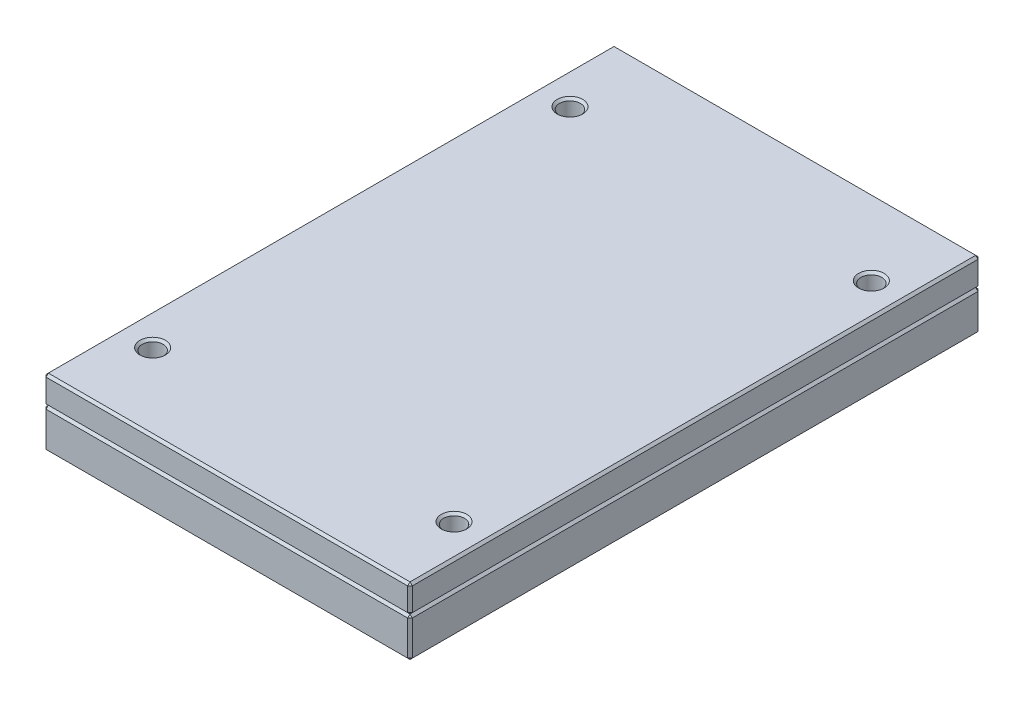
ISO-10303-21;
HEADER;
FILE_DESCRIPTION(('STEP AP214'),'2;1');
FILE_NAME('part.step','',(''),(''),'','','');
FILE_SCHEMA(('AUTOMOTIVE_DESIGN { 1 0 10303 214 1 1 1 1 }'));
ENDSEC;
DATA;
#1=APPLICATION_CONTEXT('core data for automotive mechanical design processes');
#2=APPLICATION_PROTOCOL_DEFINITION('international standard','automotive_design',2000,#1);
#3=PRODUCT_CONTEXT('',#1,'mechanical');
#4=PRODUCT('Part','Part','',(#3));
#5=PRODUCT_RELATED_PRODUCT_CATEGORY('part','',(#4));
#6=PRODUCT_DEFINITION_FORMATION('','',#4);
#7=PRODUCT_DEFINITION_CONTEXT('part definition',#1,'design');
#8=PRODUCT_DEFINITION('design','',#6,#7);
#9=PRODUCT_DEFINITION_SHAPE('','',#8);
#10=(LENGTH_UNIT() NAMED_UNIT(*) SI_UNIT(.MILLI.,.METRE.));
#11=(NAMED_UNIT(*) PLANE_ANGLE_UNIT() SI_UNIT($,.RADIAN.));
#12=(NAMED_UNIT(*) SI_UNIT($,.STERADIAN.) SOLID_ANGLE_UNIT());
#13=UNCERTAINTY_MEASURE_WITH_UNIT(LENGTH_MEASURE(1.E-05),#10,'distance_accuracy_value','');
#14=(GEOMETRIC_REPRESENTATION_CONTEXT(3) GLOBAL_UNCERTAINTY_ASSIGNED_CONTEXT((#13)) GLOBAL_UNIT_ASSIGNED_CONTEXT((#10,
#11,#12)) REPRESENTATION_CONTEXT('',''));
#15=CARTESIAN_POINT('',(0.,0.,0.));
#16=DIRECTION('',(0.,0.,1.));
#17=DIRECTION('',(1.,0.,0.));
#18=AXIS2_PLACEMENT_3D('',#15,#16,#17);
#19=CARTESIAN_POINT('',(-79.,29.,123.));
#20=DIRECTION('',(1.,0.,0.));
#21=DIRECTION('',(0.,0.,-1.));
#22=AXIS2_PLACEMENT_3D('',#19,#20,#21);
#23=PLANE('',#22);
#24=DIRECTION('',(0.,0.,1.));
#25=VECTOR('',#24,1.);
#26=CARTESIAN_POINT('',(-79.,18.,123.));
#27=LINE('',#26,#25);
#28=CARTESIAN_POINT('',(-79.,18.,-122.));
#29=VERTEX_POINT('',#28);
#30=CARTESIAN_POINT('',(-79.,18.,122.));
#31=VERTEX_POINT('',#30);
#32=EDGE_CURVE('P0_E220',#29,#31,#27,.T.);
#33=ORIENTED_EDGE('',*,*,#32,.T.);
#34=DIRECTION('',(0.,1.,0.));
#35=VECTOR('',#34,1.);
#36=CARTESIAN_POINT('',(-79.,29.,122.));
#37=LINE('',#36,#35);
#38=CARTESIAN_POINT('',(-79.,28.,122.));
#39=VERTEX_POINT('',#38);
#40=EDGE_CURVE('P0_E222',#31,#39,#37,.T.);
#41=ORIENTED_EDGE('',*,*,#40,.T.);
#42=DIRECTION('',(0.,0.,-1.));
#43=VECTOR('',#42,1.);
#44=CARTESIAN_POINT('',(-79.,28.,-123.));
#45=LINE('',#44,#43);
#46=CARTESIAN_POINT('',(-79.,28.,-122.));
#47=VERTEX_POINT('',#46);
#48=EDGE_CURVE('P0_E216',#39,#47,#45,.T.);
#49=ORIENTED_EDGE('',*,*,#48,.T.);
#50=DIRECTION('',(0.,-1.,0.));
#51=VECTOR('',#50,1.);
#52=CARTESIAN_POINT('',(-79.,29.,-122.));
#53=LINE('',#52,#51);
#54=EDGE_CURVE('P0_E218',#47,#29,#53,.T.);
#55=ORIENTED_EDGE('',*,*,#54,.T.);
#56=EDGE_LOOP('',(#33,#41,#49,#55));
#57=FACE_BOUND('',#56,.T.);
#58=ADVANCED_FACE('P0_F16',(#57),#23,.F.);
#59=CARTESIAN_POINT('',(79.,29.,123.));
#60=DIRECTION('',(0.,0.,-1.));
#61=DIRECTION('',(-1.,0.,0.));
#62=AXIS2_PLACEMENT_3D('',#59,#60,#61);
#63=PLANE('',#62);
#64=DIRECTION('',(0.,-1.,0.));
#65=VECTOR('',#64,1.);
#66=CARTESIAN_POINT('',(-78.,29.,123.));
#67=LINE('',#66,#65);
#68=CARTESIAN_POINT('',(-78.,28.,123.));
#69=VERTEX_POINT('',#68);
#70=CARTESIAN_POINT('',(-78.,18.,123.));
#71=VERTEX_POINT('',#70);
#72=EDGE_CURVE('P0_E116',#69,#71,#67,.T.);
#73=ORIENTED_EDGE('',*,*,#72,.T.);
#74=DIRECTION('',(1.,0.,0.));
#75=VECTOR('',#74,1.);
#76=CARTESIAN_POINT('',(79.,18.,123.));
#77=LINE('',#76,#75);
#78=CARTESIAN_POINT('',(78.,18.,123.));
#79=VERTEX_POINT('',#78);
#80=EDGE_CURVE('P0_E112',#71,#79,#77,.T.);
#81=ORIENTED_EDGE('',*,*,#80,.T.);
#82=DIRECTION('',(0.,1.,0.));
#83=VECTOR('',#82,1.);
#84=CARTESIAN_POINT('',(78.,29.,123.));
#85=LINE('',#84,#83);
#86=CARTESIAN_POINT('',(78.,28.,123.));
#87=VERTEX_POINT('',#86);
#88=EDGE_CURVE('P0_E106',#79,#87,#85,.T.);
#89=ORIENTED_EDGE('',*,*,#88,.T.);
#90=DIRECTION('',(-1.,0.,0.));
#91=VECTOR('',#90,1.);
#92=CARTESIAN_POINT('',(-79.,28.,123.));
#93=LINE('',#92,#91);
#94=EDGE_CURVE('P0_E109',#87,#69,#93,.T.);
#95=ORIENTED_EDGE('',*,*,#94,.T.);
#96=EDGE_LOOP('',(#73,#81,#89,#95));
#97=FACE_BOUND('',#96,.T.);
#98=ADVANCED_FACE('P0_F108',(#97),#63,.F.);
#99=CARTESIAN_POINT('',(79.,29.,123.));
#100=DIRECTION('',(-1.,0.,0.));
#101=DIRECTION('',(0.,0.,1.));
#102=AXIS2_PLACEMENT_3D('',#99,#100,#101);
#103=PLANE('',#102);
#104=DIRECTION('',(0.,0.,1.));
#105=VECTOR('',#104,1.);
#106=CARTESIAN_POINT('',(79.,28.,123.));
#107=LINE('',#106,#105);
#108=CARTESIAN_POINT('',(79.,28.,-122.));
#109=VERTEX_POINT('',#108);
#110=CARTESIAN_POINT('',(79.,28.,122.));
#111=VERTEX_POINT('',#110);
#112=EDGE_CURVE('P0_E234',#109,#111,#107,.T.);
#113=ORIENTED_EDGE('',*,*,#112,.T.);
#114=DIRECTION('',(0.,-1.,0.));
#115=VECTOR('',#114,1.);
#116=CARTESIAN_POINT('',(79.,29.,122.));
#117=LINE('',#116,#115);
#118=CARTESIAN_POINT('',(79.,18.,122.));
#119=VERTEX_POINT('',#118);
#120=EDGE_CURVE('P0_E139',#111,#119,#117,.T.);
#121=ORIENTED_EDGE('',*,*,#120,.T.);
#122=DIRECTION('',(0.,0.,-1.));
#123=VECTOR('',#122,1.);
#124=CARTESIAN_POINT('',(79.,18.,123.));
#125=LINE('',#124,#123);
#126=CARTESIAN_POINT('',(79.,18.,-122.));
#127=VERTEX_POINT('',#126);
#128=EDGE_CURVE('P0_E238',#119,#127,#125,.T.);
#129=ORIENTED_EDGE('',*,*,#128,.T.);
#130=DIRECTION('',(0.,1.,0.));
#131=VECTOR('',#130,1.);
#132=CARTESIAN_POINT('',(79.,29.,-122.));
#133=LINE('',#132,#131);
#134=EDGE_CURVE('P0_E236',#127,#109,#133,.T.);
#135=ORIENTED_EDGE('',*,*,#134,.T.);
#136=EDGE_LOOP('',(#113,#121,#129,#135));
#137=FACE_BOUND('',#136,.T.);
#138=ADVANCED_FACE('P0_F307',(#137),#103,.F.);
#139=CARTESIAN_POINT('',(79.,29.,-123.));
#140=DIRECTION('',(0.,0.,1.));
#141=DIRECTION('',(1.,0.,0.));
#142=AXIS2_PLACEMENT_3D('',#139,#140,#141);
#143=PLANE('',#142);
#144=DIRECTION('',(-1.,0.,0.));
#145=VECTOR('',#144,1.);
#146=CARTESIAN_POINT('',(79.,18.,-123.));
#147=LINE('',#146,#145);
#148=CARTESIAN_POINT('',(78.,18.,-123.));
#149=VERTEX_POINT('',#148);
#150=CARTESIAN_POINT('',(-78.,18.,-123.));
#151=VERTEX_POINT('',#150);
#152=EDGE_CURVE('P0_E229',#149,#151,#147,.T.);
#153=ORIENTED_EDGE('',*,*,#152,.T.);
#154=DIRECTION('',(0.,1.,0.));
#155=VECTOR('',#154,1.);
#156=CARTESIAN_POINT('',(-78.,29.,-123.));
#157=LINE('',#156,#155);
#158=CARTESIAN_POINT('',(-78.,28.,-123.));
#159=VERTEX_POINT('',#158);
#160=EDGE_CURVE('P0_E231',#151,#159,#157,.T.);
#161=ORIENTED_EDGE('',*,*,#160,.T.);
#162=DIRECTION('',(1.,0.,0.));
#163=VECTOR('',#162,1.);
#164=CARTESIAN_POINT('',(79.,28.,-123.));
#165=LINE('',#164,#163);
#166=CARTESIAN_POINT('',(78.,28.,-123.));
#167=VERTEX_POINT('',#166);
#168=EDGE_CURVE('P0_E225',#159,#167,#165,.T.);
#169=ORIENTED_EDGE('',*,*,#168,.T.);
#170=DIRECTION('',(0.,-1.,0.));
#171=VECTOR('',#170,1.);
#172=CARTESIAN_POINT('',(78.,29.,-123.));
#173=LINE('',#172,#171);
#174=EDGE_CURVE('P0_E227',#167,#149,#173,.T.);
#175=ORIENTED_EDGE('',*,*,#174,.T.);
#176=EDGE_LOOP('',(#153,#161,#169,#175));
#177=FACE_BOUND('',#176,.T.);
#178=ADVANCED_FACE('P0_F318',(#177),#143,.F.);
#179=CARTESIAN_POINT('',(0.,29.,0.));
#180=DIRECTION('',(0.,1.,0.));
#181=DIRECTION('',(0.,0.,1.));
#182=AXIS2_PLACEMENT_3D('',#179,#180,#181);
#183=PLANE('',#182);
#184=DIRECTION('',(0.,0.,-1.));
#185=VECTOR('',#184,1.);
#186=CARTESIAN_POINT('',(78.,29.,-123.));
#187=LINE('',#186,#185);
#188=CARTESIAN_POINT('',(78.,29.,122.));
#189=VERTEX_POINT('',#188);
#190=CARTESIAN_POINT('',(78.,29.,-122.));
#191=VERTEX_POINT('',#190);
#192=EDGE_CURVE('P0_E33',#189,#191,#187,.T.);
#193=ORIENTED_EDGE('',*,*,#192,.T.);
#194=DIRECTION('',(-1.,0.,0.));
#195=VECTOR('',#194,1.);
#196=CARTESIAN_POINT('',(-79.,29.,-122.));
#197=LINE('',#196,#195);
#198=CARTESIAN_POINT('',(-78.,29.,-122.));
#199=VERTEX_POINT('',#198);
#200=EDGE_CURVE('P0_E257',#191,#199,#197,.T.);
#201=ORIENTED_EDGE('',*,*,#200,.T.);
#202=DIRECTION('',(0.,0.,1.));
#203=VECTOR('',#202,1.);
#204=CARTESIAN_POINT('',(-78.,29.,123.));
#205=LINE('',#204,#203);
#206=CARTESIAN_POINT('',(-78.,29.,122.));
#207=VERTEX_POINT('',#206);
#208=EDGE_CURVE('P0_E253',#199,#207,#205,.T.);
#209=ORIENTED_EDGE('',*,*,#208,.T.);
#210=DIRECTION('',(1.,0.,0.));
#211=VECTOR('',#210,1.);
#212=CARTESIAN_POINT('',(79.,29.,122.));
#213=LINE('',#212,#211);
#214=EDGE_CURVE('P0_E38',#207,#189,#213,.T.);
#215=ORIENTED_EDGE('',*,*,#214,.T.);
#216=EDGE_LOOP('',(#193,#201,#209,#215));
#217=FACE_BOUND('',#216,.T.);
#218=CARTESIAN_POINT('',(65.,29.,90.));
#219=DIRECTION('',(0.,1.,0.));
#220=DIRECTION('',(0.,0.,1.));
#221=AXIS2_PLACEMENT_3D('',#218,#219,#220);
#222=CIRCLE('',#221,5.50000000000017);
#223=CARTESIAN_POINT('',(65.,29.,95.5000000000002));
#224=VERTEX_POINT('',#223);
#225=EDGE_CURVE('P0_E250',#224,#224,#222,.F.);
#226=ORIENTED_EDGE('',*,*,#225,.T.);
#227=EDGE_LOOP('',(#226));
#228=FACE_BOUND('',#227,.T.);
#229=CARTESIAN_POINT('',(-65.,29.,90.));
#230=DIRECTION('',(0.,1.,0.));
#231=DIRECTION('',(0.,0.,1.));
#232=AXIS2_PLACEMENT_3D('',#229,#230,#231);
#233=CIRCLE('',#232,5.50000000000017);
#234=CARTESIAN_POINT('',(-65.,29.,95.5000000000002));
#235=VERTEX_POINT('',#234);
#236=EDGE_CURVE('P0_E247',#235,#235,#233,.F.);
#237=ORIENTED_EDGE('',*,*,#236,.T.);
#238=EDGE_LOOP('',(#237));
#239=FACE_BOUND('',#238,.T.);
#240=CARTESIAN_POINT('',(65.,29.,-90.));
#241=DIRECTION('',(0.,1.,0.));
#242=DIRECTION('',(0.,0.,1.));
#243=AXIS2_PLACEMENT_3D('',#240,#241,#242);
#244=CIRCLE('',#243,5.50000000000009);
#245=CARTESIAN_POINT('',(65.,29.,-84.4999999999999));
#246=VERTEX_POINT('',#245);
#247=EDGE_CURVE('P0_E244',#246,#246,#244,.F.);
#248=ORIENTED_EDGE('',*,*,#247,.T.);
#249=EDGE_LOOP('',(#248));
#250=FACE_BOUND('',#249,.T.);
#251=CARTESIAN_POINT('',(-65.,29.,-90.));
#252=DIRECTION('',(0.,1.,0.));
#253=DIRECTION('',(0.,0.,1.));
#254=AXIS2_PLACEMENT_3D('',#251,#252,#253);
#255=CIRCLE('',#254,5.50000000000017);
#256=CARTESIAN_POINT('',(-65.,29.,-84.4999999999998));
#257=VERTEX_POINT('',#256);
#258=EDGE_CURVE('P0_E241',#257,#257,#255,.F.);
#259=ORIENTED_EDGE('',*,*,#258,.T.);
#260=EDGE_LOOP('',(#259));
#261=FACE_BOUND('',#260,.T.);
#262=ADVANCED_FACE('P0_F335',(#217,#228,#239,#250,#261),#183,.T.);
#263=CARTESIAN_POINT('',(0.,17.,0.));
#264=DIRECTION('',(0.,1.,0.));
#265=DIRECTION('',(0.,0.,1.));
#266=AXIS2_PLACEMENT_3D('',#263,#264,#265);
#267=PLANE('',#266);
#268=DIRECTION('',(0.,0.,1.));
#269=VECTOR('',#268,1.);
#270=CARTESIAN_POINT('',(78.,17.,0.));
#271=LINE('',#270,#269);
#272=CARTESIAN_POINT('',(78.,17.,-122.));
#273=VERTEX_POINT('',#272);
#274=CARTESIAN_POINT('',(78.,17.,122.));
#275=VERTEX_POINT('',#274);
#276=EDGE_CURVE('P0_E207',#273,#275,#271,.T.);
#277=ORIENTED_EDGE('',*,*,#276,.T.);
#278=DIRECTION('',(-1.,0.,0.));
#279=VECTOR('',#278,1.);
#280=CARTESIAN_POINT('',(0.,17.,122.));
#281=LINE('',#280,#279);
#282=CARTESIAN_POINT('',(-78.,17.,122.));
#283=VERTEX_POINT('',#282);
#284=EDGE_CURVE('P0_E213',#275,#283,#281,.T.);
#285=ORIENTED_EDGE('',*,*,#284,.T.);
#286=DIRECTION('',(0.,0.,-1.));
#287=VECTOR('',#286,1.);
#288=CARTESIAN_POINT('',(-78.,17.,0.));
#289=LINE('',#288,#287);
#290=CARTESIAN_POINT('',(-78.,17.,-122.));
#291=VERTEX_POINT('',#290);
#292=EDGE_CURVE('P0_E211',#283,#291,#289,.T.);
#293=ORIENTED_EDGE('',*,*,#292,.T.);
#294=DIRECTION('',(1.,0.,0.));
#295=VECTOR('',#294,1.);
#296=CARTESIAN_POINT('',(0.,17.,-122.));
#297=LINE('',#296,#295);
#298=EDGE_CURVE('P0_E209',#291,#273,#297,.T.);
#299=ORIENTED_EDGE('',*,*,#298,.T.);
#300=EDGE_LOOP('',(#277,#285,#293,#299));
#301=FACE_BOUND('',#300,.T.);
#302=CARTESIAN_POINT('',(-65.,17.,-90.));
#303=DIRECTION('',(0.,1.,0.));
#304=DIRECTION('',(0.,0.,1.));
#305=AXIS2_PLACEMENT_3D('',#302,#303,#304);
#306=CIRCLE('',#305,4.5);
#307=CARTESIAN_POINT('',(-65.,17.,-85.5));
#308=VERTEX_POINT('',#307);
#309=EDGE_CURVE('P0_E127',#308,#308,#306,.T.);
#310=ORIENTED_EDGE('',*,*,#309,.T.);
#311=EDGE_LOOP('',(#310));
#312=FACE_BOUND('',#311,.T.);
#313=CARTESIAN_POINT('',(65.,17.,-90.));
#314=DIRECTION('',(0.,1.,0.));
#315=DIRECTION('',(0.,0.,1.));
#316=AXIS2_PLACEMENT_3D('',#313,#314,#315);
#317=CIRCLE('',#316,4.5);
#318=CARTESIAN_POINT('',(65.,17.,-85.5));
#319=VERTEX_POINT('',#318);
#320=EDGE_CURVE('P0_E198',#319,#319,#317,.T.);
#321=ORIENTED_EDGE('',*,*,#320,.T.);
#322=EDGE_LOOP('',(#321));
#323=FACE_BOUND('',#322,.T.);
#324=CARTESIAN_POINT('',(-65.,17.,90.));
#325=DIRECTION('',(0.,1.,0.));
#326=DIRECTION('',(0.,0.,1.));
#327=AXIS2_PLACEMENT_3D('',#324,#325,#326);
#328=CIRCLE('',#327,4.5);
#329=CARTESIAN_POINT('',(-65.,17.,94.5));
#330=VERTEX_POINT('',#329);
#331=EDGE_CURVE('P0_E193',#330,#330,#328,.T.);
#332=ORIENTED_EDGE('',*,*,#331,.T.);
#333=EDGE_LOOP('',(#332));
#334=FACE_BOUND('',#333,.T.);
#335=CARTESIAN_POINT('',(65.,17.,90.));
#336=DIRECTION('',(0.,1.,0.));
#337=DIRECTION('',(0.,0.,1.));
#338=AXIS2_PLACEMENT_3D('',#335,#336,#337);
#339=CIRCLE('',#338,4.5);
#340=CARTESIAN_POINT('',(65.,17.,94.5));
#341=VERTEX_POINT('',#340);
#342=EDGE_CURVE('P0_E186',#341,#341,#339,.T.);
#343=ORIENTED_EDGE('',*,*,#342,.T.);
#344=EDGE_LOOP('',(#343));
#345=FACE_BOUND('',#344,.T.);
#346=ADVANCED_FACE('P0_F292',(#301,#312,#323,#334,#345),#267,.F.);
#347=CARTESIAN_POINT('',(65.,0.,90.));
#348=DIRECTION('',(0.,1.,0.));
#349=DIRECTION('',(0.,0.,1.));
#350=AXIS2_PLACEMENT_3D('',#347,#348,#349);
#351=CYLINDRICAL_SURFACE('',#350,4.5);
#352=CARTESIAN_POINT('',(65.,28.,90.));
#353=DIRECTION('',(0.,1.,0.));
#354=DIRECTION('',(0.,0.,1.));
#355=AXIS2_PLACEMENT_3D('',#352,#353,#354);
#356=CIRCLE('',#355,4.5);
#357=CARTESIAN_POINT('',(65.,28.,94.5));
#358=VERTEX_POINT('',#357);
#359=EDGE_CURVE('P0_E259',#358,#358,#356,.T.);
#360=ORIENTED_EDGE('',*,*,#359,.T.);
#361=EDGE_LOOP('',(#360));
#362=FACE_BOUND('',#361,.T.);
#363=ORIENTED_EDGE('',*,*,#342,.F.);
#364=EDGE_LOOP('',(#363));
#365=FACE_BOUND('',#364,.T.);
#366=ADVANCED_FACE('P0_F427',(#362,#365),#351,.F.);
#367=CARTESIAN_POINT('',(-65.,0.,90.));
#368=DIRECTION('',(0.,1.,0.));
#369=DIRECTION('',(0.,0.,1.));
#370=AXIS2_PLACEMENT_3D('',#367,#368,#369);
#371=CYLINDRICAL_SURFACE('',#370,4.5);
#372=CARTESIAN_POINT('',(-65.,28.,90.));
#373=DIRECTION('',(0.,1.,0.));
#374=DIRECTION('',(0.,0.,1.));
#375=AXIS2_PLACEMENT_3D('',#372,#373,#374);
#376=CIRCLE('',#375,4.5);
#377=CARTESIAN_POINT('',(-65.,28.,94.5));
#378=VERTEX_POINT('',#377);
#379=EDGE_CURVE('P0_E262',#378,#378,#376,.T.);
#380=ORIENTED_EDGE('',*,*,#379,.T.);
#381=EDGE_LOOP('',(#380));
#382=FACE_BOUND('',#381,.T.);
#383=ORIENTED_EDGE('',*,*,#331,.F.);
#384=EDGE_LOOP('',(#383));
#385=FACE_BOUND('',#384,.T.);
#386=ADVANCED_FACE('P0_F421',(#382,#385),#371,.F.);
#387=CARTESIAN_POINT('',(65.,0.,-90.));
#388=DIRECTION('',(0.,1.,0.));
#389=DIRECTION('',(0.,0.,1.));
#390=AXIS2_PLACEMENT_3D('',#387,#388,#389);
#391=CYLINDRICAL_SURFACE('',#390,4.5);
#392=CARTESIAN_POINT('',(65.,28.,-90.));
#393=DIRECTION('',(0.,1.,0.));
#394=DIRECTION('',(0.,0.,1.));
#395=AXIS2_PLACEMENT_3D('',#392,#393,#394);
#396=CIRCLE('',#395,4.5);
#397=CARTESIAN_POINT('',(65.,28.,-85.5));
#398=VERTEX_POINT('',#397);
#399=EDGE_CURVE('P0_E25',#398,#398,#396,.T.);
#400=ORIENTED_EDGE('',*,*,#399,.T.);
#401=EDGE_LOOP('',(#400));
#402=FACE_BOUND('',#401,.T.);
#403=ORIENTED_EDGE('',*,*,#320,.F.);
#404=EDGE_LOOP('',(#403));
#405=FACE_BOUND('',#404,.T.);
#406=ADVANCED_FACE('P0_F418',(#402,#405),#391,.F.);
#407=CARTESIAN_POINT('',(-65.,0.,-90.));
#408=DIRECTION('',(0.,1.,0.));
#409=DIRECTION('',(0.,0.,1.));
#410=AXIS2_PLACEMENT_3D('',#407,#408,#409);
#411=CYLINDRICAL_SURFACE('',#410,4.5);
#412=CARTESIAN_POINT('',(-65.,28.,-90.));
#413=DIRECTION('',(0.,1.,0.));
#414=DIRECTION('',(0.,0.,1.));
#415=AXIS2_PLACEMENT_3D('',#412,#413,#414);
#416=CIRCLE('',#415,4.5);
#417=CARTESIAN_POINT('',(-65.,28.,-85.5));
#418=VERTEX_POINT('',#417);
#419=EDGE_CURVE('P0_E10',#418,#418,#416,.T.);
#420=ORIENTED_EDGE('',*,*,#419,.T.);
#421=EDGE_LOOP('',(#420));
#422=FACE_BOUND('',#421,.T.);
#423=ORIENTED_EDGE('',*,*,#309,.F.);
#424=EDGE_LOOP('',(#423));
#425=FACE_BOUND('',#424,.T.);
#426=ADVANCED_FACE('P0_F399',(#422,#425),#411,.F.);
#427=CARTESIAN_POINT('',(0.,29.,-122.));
#428=DIRECTION('',(0.,0.707106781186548,-0.707106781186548));
#429=DIRECTION('',(1.,0.,0.));
#430=AXIS2_PLACEMENT_3D('',#427,#428,#429);
#431=PLANE('',#430);
#432=DIRECTION('',(0.,-0.707106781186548,-0.707106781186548));
#433=VECTOR('',#432,1.);
#434=CARTESIAN_POINT('',(-78.,28.,-123.));
#435=LINE('',#434,#433);
#436=EDGE_CURVE('P0_E20',#199,#159,#435,.T.);
#437=ORIENTED_EDGE('',*,*,#436,.F.);
#438=ORIENTED_EDGE('',*,*,#200,.F.);
#439=DIRECTION('',(0.,0.707106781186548,0.707106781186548));
#440=VECTOR('',#439,1.);
#441=CARTESIAN_POINT('',(78.,28.5,-122.5));
#442=LINE('',#441,#440);
#443=EDGE_CURVE('P0_E179',#167,#191,#442,.T.);
#444=ORIENTED_EDGE('',*,*,#443,.F.);
#445=ORIENTED_EDGE('',*,*,#168,.F.);
#446=EDGE_LOOP('',(#437,#438,#444,#445));
#447=FACE_BOUND('',#446,.T.);
#448=ADVANCED_FACE('P0_F334',(#447),#431,.T.);
#449=CARTESIAN_POINT('',(-78.,28.,-123.));
#450=DIRECTION('',(-0.577350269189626,0.577350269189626,-0.577350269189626));
#451=DIRECTION('',(-0.707106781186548,0.,0.707106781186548));
#452=AXIS2_PLACEMENT_3D('',#449,#450,#451);
#453=PLANE('',#452);
#454=DIRECTION('',(0.707106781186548,0.707106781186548,0.));
#455=VECTOR('',#454,1.);
#456=CARTESIAN_POINT('',(-78.5,28.5,-122.));
#457=LINE('',#456,#455);
#458=EDGE_CURVE('P0_E175',#199,#47,#457,.F.);
#459=ORIENTED_EDGE('',*,*,#458,.F.);
#460=ORIENTED_EDGE('',*,*,#436,.T.);
#461=DIRECTION('',(0.707106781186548,0.,-0.707106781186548));
#462=VECTOR('',#461,1.);
#463=CARTESIAN_POINT('',(-78.,28.,-123.));
#464=LINE('',#463,#462);
#465=EDGE_CURVE('P0_E178',#47,#159,#464,.T.);
#466=ORIENTED_EDGE('',*,*,#465,.F.);
#467=EDGE_LOOP('',(#459,#460,#466));
#468=FACE_BOUND('',#467,.T.);
#469=ADVANCED_FACE('P0_F330',(#468),#453,.T.);
#470=CARTESIAN_POINT('',(79.,28.,-122.));
#471=DIRECTION('',(0.577350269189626,0.577350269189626,-0.577350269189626));
#472=DIRECTION('',(-0.707106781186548,0.,-0.707106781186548));
#473=AXIS2_PLACEMENT_3D('',#470,#471,#472);
#474=PLANE('',#473);
#475=DIRECTION('',(0.707106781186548,0.,0.707106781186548));
#476=VECTOR('',#475,1.);
#477=CARTESIAN_POINT('',(79.,28.,-122.));
#478=LINE('',#477,#476);
#479=EDGE_CURVE('P0_E169',#167,#109,#478,.T.);
#480=ORIENTED_EDGE('',*,*,#479,.F.);
#481=ORIENTED_EDGE('',*,*,#443,.T.);
#482=DIRECTION('',(0.707106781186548,-0.707106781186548,0.));
#483=VECTOR('',#482,1.);
#484=CARTESIAN_POINT('',(79.,28.,-122.));
#485=LINE('',#484,#483);
#486=EDGE_CURVE('P0_E172',#109,#191,#485,.F.);
#487=ORIENTED_EDGE('',*,*,#486,.F.);
#488=EDGE_LOOP('',(#480,#481,#487));
#489=FACE_BOUND('',#488,.T.);
#490=ADVANCED_FACE('P0_F311',(#489),#474,.T.);
#491=CARTESIAN_POINT('',(-79.,29.,-122.));
#492=DIRECTION('',(0.707106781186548,0.,0.707106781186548));
#493=DIRECTION('',(0.,-1.,0.));
#494=AXIS2_PLACEMENT_3D('',#491,#492,#493);
#495=PLANE('',#494);
#496=ORIENTED_EDGE('',*,*,#465,.T.);
#497=ORIENTED_EDGE('',*,*,#160,.F.);
#498=DIRECTION('',(-0.707106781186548,0.,0.707106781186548));
#499=VECTOR('',#498,1.);
#500=CARTESIAN_POINT('',(-78.5,18.,-122.5));
#501=LINE('',#500,#499);
#502=EDGE_CURVE('P0_E163',#29,#151,#501,.F.);
#503=ORIENTED_EDGE('',*,*,#502,.F.);
#504=ORIENTED_EDGE('',*,*,#54,.F.);
#505=EDGE_LOOP('',(#496,#497,#503,#504));
#506=FACE_BOUND('',#505,.T.);
#507=ADVANCED_FACE('P0_F329',(#506),#495,.F.);
#508=CARTESIAN_POINT('',(-78.,29.,0.));
#509=DIRECTION('',(-0.707106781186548,0.707106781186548,0.));
#510=DIRECTION('',(0.,0.,-1.));
#511=AXIS2_PLACEMENT_3D('',#508,#509,#510);
#512=PLANE('',#511);
#513=ORIENTED_EDGE('',*,*,#458,.T.);
#514=ORIENTED_EDGE('',*,*,#48,.F.);
#515=DIRECTION('',(-0.707106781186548,-0.707106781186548,0.));
#516=VECTOR('',#515,1.);
#517=CARTESIAN_POINT('',(-79.,28.,122.));
#518=LINE('',#517,#516);
#519=EDGE_CURVE('P0_E160',#207,#39,#518,.T.);
#520=ORIENTED_EDGE('',*,*,#519,.F.);
#521=ORIENTED_EDGE('',*,*,#208,.F.);
#522=EDGE_LOOP('',(#513,#514,#520,#521));
#523=FACE_BOUND('',#522,.T.);
#524=ADVANCED_FACE('P0_F338',(#523),#512,.T.);
#525=CARTESIAN_POINT('',(0.,29.,122.));
#526=DIRECTION('',(0.,0.707106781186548,0.707106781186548));
#527=DIRECTION('',(-1.,0.,0.));
#528=AXIS2_PLACEMENT_3D('',#525,#526,#527);
#529=PLANE('',#528);
#530=DIRECTION('',(0.,-0.707106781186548,0.707106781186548));
#531=VECTOR('',#530,1.);
#532=CARTESIAN_POINT('',(78.,28.,123.));
#533=LINE('',#532,#531);
#534=EDGE_CURVE('P0_E122',#189,#87,#533,.T.);
#535=ORIENTED_EDGE('',*,*,#534,.F.);
#536=ORIENTED_EDGE('',*,*,#214,.F.);
#537=DIRECTION('',(0.,0.707106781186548,-0.707106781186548));
#538=VECTOR('',#537,1.);
#539=CARTESIAN_POINT('',(-78.,28.5,122.5));
#540=LINE('',#539,#538);
#541=EDGE_CURVE('P0_E125',#69,#207,#540,.T.);
#542=ORIENTED_EDGE('',*,*,#541,.F.);
#543=ORIENTED_EDGE('',*,*,#94,.F.);
#544=EDGE_LOOP('',(#535,#536,#542,#543));
#545=FACE_BOUND('',#544,.T.);
#546=ADVANCED_FACE('P0_F121',(#545),#529,.T.);
#547=CARTESIAN_POINT('',(78.,29.,0.));
#548=DIRECTION('',(0.707106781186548,0.707106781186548,0.));
#549=DIRECTION('',(0.,0.,1.));
#550=AXIS2_PLACEMENT_3D('',#547,#548,#549);
#551=PLANE('',#550);
#552=ORIENTED_EDGE('',*,*,#486,.T.);
#553=ORIENTED_EDGE('',*,*,#192,.F.);
#554=DIRECTION('',(-0.707106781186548,0.707106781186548,0.));
#555=VECTOR('',#554,1.);
#556=CARTESIAN_POINT('',(78.5,28.5,122.));
#557=LINE('',#556,#555);
#558=EDGE_CURVE('P0_E135',#111,#189,#557,.T.);
#559=ORIENTED_EDGE('',*,*,#558,.F.);
#560=ORIENTED_EDGE('',*,*,#112,.F.);
#561=EDGE_LOOP('',(#552,#553,#559,#560));
#562=FACE_BOUND('',#561,.T.);
#563=ADVANCED_FACE('P0_F310',(#562),#551,.T.);
#564=CARTESIAN_POINT('',(78.,29.,-123.));
#565=DIRECTION('',(-0.707106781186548,0.,0.707106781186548));
#566=DIRECTION('',(0.,-1.,0.));
#567=AXIS2_PLACEMENT_3D('',#564,#565,#566);
#568=PLANE('',#567);
#569=ORIENTED_EDGE('',*,*,#479,.T.);
#570=ORIENTED_EDGE('',*,*,#134,.F.);
#571=DIRECTION('',(-0.707106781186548,0.,-0.707106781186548));
#572=VECTOR('',#571,1.);
#573=CARTESIAN_POINT('',(78.5,18.,-122.5));
#574=LINE('',#573,#572);
#575=EDGE_CURVE('P0_E155',#149,#127,#574,.F.);
#576=ORIENTED_EDGE('',*,*,#575,.F.);
#577=ORIENTED_EDGE('',*,*,#174,.F.);
#578=EDGE_LOOP('',(#569,#570,#576,#577));
#579=FACE_BOUND('',#578,.T.);
#580=ADVANCED_FACE('P0_F315',(#579),#568,.F.);
#581=CARTESIAN_POINT('',(79.,18.,-123.));
#582=DIRECTION('',(0.,0.707106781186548,0.707106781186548));
#583=DIRECTION('',(-1.,0.,0.));
#584=AXIS2_PLACEMENT_3D('',#581,#582,#583);
#585=PLANE('',#584);
#586=DIRECTION('',(0.,0.707106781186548,-0.707106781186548));
#587=VECTOR('',#586,1.);
#588=CARTESIAN_POINT('',(-78.,17.,-122.));
#589=LINE('',#588,#587);
#590=EDGE_CURVE('P0_E166',#151,#291,#589,.F.);
#591=ORIENTED_EDGE('',*,*,#590,.F.);
#592=ORIENTED_EDGE('',*,*,#152,.F.);
#593=DIRECTION('',(0.,-0.707106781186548,0.707106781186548));
#594=VECTOR('',#593,1.);
#595=CARTESIAN_POINT('',(78.,17.,-122.));
#596=LINE('',#595,#594);
#597=EDGE_CURVE('P0_E152',#273,#149,#596,.F.);
#598=ORIENTED_EDGE('',*,*,#597,.F.);
#599=ORIENTED_EDGE('',*,*,#298,.F.);
#600=EDGE_LOOP('',(#591,#592,#598,#599));
#601=FACE_BOUND('',#600,.T.);
#602=ADVANCED_FACE('P0_F323',(#601),#585,.F.);
#603=CARTESIAN_POINT('',(-78.,17.,-122.));
#604=DIRECTION('',(-0.577350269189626,-0.577350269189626,-0.577350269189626));
#605=DIRECTION('',(-0.707106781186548,0.,0.707106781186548));
#606=AXIS2_PLACEMENT_3D('',#603,#604,#605);
#607=PLANE('',#606);
#608=ORIENTED_EDGE('',*,*,#502,.T.);
#609=ORIENTED_EDGE('',*,*,#590,.T.);
#610=DIRECTION('',(0.707106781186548,-0.707106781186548,0.));
#611=VECTOR('',#610,1.);
#612=CARTESIAN_POINT('',(-78.,17.,-122.));
#613=LINE('',#612,#611);
#614=EDGE_CURVE('P0_E143',#29,#291,#613,.T.);
#615=ORIENTED_EDGE('',*,*,#614,.F.);
#616=EDGE_LOOP('',(#608,#609,#615));
#617=FACE_BOUND('',#616,.T.);
#618=ADVANCED_FACE('P0_F326',(#617),#607,.T.);
#619=CARTESIAN_POINT('',(-79.,28.,122.));
#620=DIRECTION('',(-0.577350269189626,0.577350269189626,0.577350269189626));
#621=DIRECTION('',(0.707106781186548,0.,0.707106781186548));
#622=AXIS2_PLACEMENT_3D('',#619,#620,#621);
#623=PLANE('',#622);
#624=ORIENTED_EDGE('',*,*,#541,.T.);
#625=ORIENTED_EDGE('',*,*,#519,.T.);
#626=DIRECTION('',(-0.707106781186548,0.,-0.707106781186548));
#627=VECTOR('',#626,1.);
#628=CARTESIAN_POINT('',(-79.,28.,122.));
#629=LINE('',#628,#627);
#630=EDGE_CURVE('P0_E140',#69,#39,#629,.T.);
#631=ORIENTED_EDGE('',*,*,#630,.F.);
#632=EDGE_LOOP('',(#624,#625,#631));
#633=FACE_BOUND('',#632,.T.);
#634=ADVANCED_FACE('P0_F340',(#633),#623,.T.);
#635=CARTESIAN_POINT('',(78.,28.,123.));
#636=DIRECTION('',(0.577350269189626,0.577350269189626,0.577350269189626));
#637=DIRECTION('',(0.707106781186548,0.,-0.707106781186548));
#638=AXIS2_PLACEMENT_3D('',#635,#636,#637);
#639=PLANE('',#638);
#640=ORIENTED_EDGE('',*,*,#558,.T.);
#641=ORIENTED_EDGE('',*,*,#534,.T.);
#642=DIRECTION('',(-0.707106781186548,0.,0.707106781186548));
#643=VECTOR('',#642,1.);
#644=CARTESIAN_POINT('',(78.,28.,123.));
#645=LINE('',#644,#643);
#646=EDGE_CURVE('P0_E132',#111,#87,#645,.T.);
#647=ORIENTED_EDGE('',*,*,#646,.F.);
#648=EDGE_LOOP('',(#640,#641,#647));
#649=FACE_BOUND('',#648,.T.);
#650=ADVANCED_FACE('P0_F131',(#649),#639,.T.);
#651=CARTESIAN_POINT('',(78.,17.,-122.));
#652=DIRECTION('',(0.577350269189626,-0.577350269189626,-0.577350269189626));
#653=DIRECTION('',(-0.707106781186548,0.,-0.707106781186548));
#654=AXIS2_PLACEMENT_3D('',#651,#652,#653);
#655=PLANE('',#654);
#656=ORIENTED_EDGE('',*,*,#597,.T.);
#657=ORIENTED_EDGE('',*,*,#575,.T.);
#658=DIRECTION('',(0.707106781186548,0.707106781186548,0.));
#659=VECTOR('',#658,1.);
#660=CARTESIAN_POINT('',(78.,17.,-122.));
#661=LINE('',#660,#659);
#662=EDGE_CURVE('P0_E141',#273,#127,#661,.T.);
#663=ORIENTED_EDGE('',*,*,#662,.F.);
#664=EDGE_LOOP('',(#656,#657,#663));
#665=FACE_BOUND('',#664,.T.);
#666=ADVANCED_FACE('P0_F371',(#665),#655,.T.);
#667=CARTESIAN_POINT('',(-79.,18.,123.));
#668=DIRECTION('',(0.707106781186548,0.707106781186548,0.));
#669=DIRECTION('',(0.,0.,1.));
#670=AXIS2_PLACEMENT_3D('',#667,#668,#669);
#671=PLANE('',#670);
#672=ORIENTED_EDGE('',*,*,#614,.T.);
#673=ORIENTED_EDGE('',*,*,#292,.F.);
#674=DIRECTION('',(-0.707106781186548,0.707106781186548,0.));
#675=VECTOR('',#674,1.);
#676=CARTESIAN_POINT('',(-78.,17.,122.));
#677=LINE('',#676,#675);
#678=EDGE_CURVE('P0_E146',#31,#283,#677,.F.);
#679=ORIENTED_EDGE('',*,*,#678,.F.);
#680=ORIENTED_EDGE('',*,*,#32,.F.);
#681=EDGE_LOOP('',(#672,#673,#679,#680));
#682=FACE_BOUND('',#681,.T.);
#683=ADVANCED_FACE('P0_F287',(#682),#671,.F.);
#684=CARTESIAN_POINT('',(-78.,29.,123.));
#685=DIRECTION('',(0.707106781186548,0.,-0.707106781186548));
#686=DIRECTION('',(0.,-1.,0.));
#687=AXIS2_PLACEMENT_3D('',#684,#685,#686);
#688=PLANE('',#687);
#689=ORIENTED_EDGE('',*,*,#630,.T.);
#690=ORIENTED_EDGE('',*,*,#40,.F.);
#691=DIRECTION('',(0.707106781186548,0.,0.707106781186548));
#692=VECTOR('',#691,1.);
#693=CARTESIAN_POINT('',(-78.5,18.,122.5));
#694=LINE('',#693,#692);
#695=EDGE_CURVE('P0_E276',#71,#31,#694,.F.);
#696=ORIENTED_EDGE('',*,*,#695,.F.);
#697=ORIENTED_EDGE('',*,*,#72,.F.);
#698=EDGE_LOOP('',(#689,#690,#696,#697));
#699=FACE_BOUND('',#698,.T.);
#700=ADVANCED_FACE('P0_F344',(#699),#688,.F.);
#701=CARTESIAN_POINT('',(79.,29.,122.));
#702=DIRECTION('',(-0.707106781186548,0.,-0.707106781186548));
#703=DIRECTION('',(0.,-1.,0.));
#704=AXIS2_PLACEMENT_3D('',#701,#702,#703);
#705=PLANE('',#704);
#706=ORIENTED_EDGE('',*,*,#646,.T.);
#707=ORIENTED_EDGE('',*,*,#88,.F.);
#708=DIRECTION('',(0.707106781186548,0.,-0.707106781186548));
#709=VECTOR('',#708,1.);
#710=CARTESIAN_POINT('',(78.,18.,123.));
#711=LINE('',#710,#709);
#712=EDGE_CURVE('P0_E273',#119,#79,#711,.F.);
#713=ORIENTED_EDGE('',*,*,#712,.F.);
#714=ORIENTED_EDGE('',*,*,#120,.F.);
#715=EDGE_LOOP('',(#706,#707,#713,#714));
#716=FACE_BOUND('',#715,.T.);
#717=ADVANCED_FACE('P0_F137',(#716),#705,.F.);
#718=CARTESIAN_POINT('',(79.,18.,123.));
#719=DIRECTION('',(-0.707106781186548,0.707106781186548,0.));
#720=DIRECTION('',(0.,0.,-1.));
#721=AXIS2_PLACEMENT_3D('',#718,#719,#720);
#722=PLANE('',#721);
#723=ORIENTED_EDGE('',*,*,#662,.T.);
#724=ORIENTED_EDGE('',*,*,#128,.F.);
#725=DIRECTION('',(-0.707106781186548,-0.707106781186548,0.));
#726=VECTOR('',#725,1.);
#727=CARTESIAN_POINT('',(78.5,17.5,122.));
#728=LINE('',#727,#726);
#729=EDGE_CURVE('P0_E271',#275,#119,#728,.F.);
#730=ORIENTED_EDGE('',*,*,#729,.F.);
#731=ORIENTED_EDGE('',*,*,#276,.F.);
#732=EDGE_LOOP('',(#723,#724,#730,#731));
#733=FACE_BOUND('',#732,.T.);
#734=ADVANCED_FACE('P0_F303',(#733),#722,.F.);
#735=CARTESIAN_POINT('',(-78.,17.,122.));
#736=DIRECTION('',(-0.577350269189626,-0.577350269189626,0.577350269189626));
#737=DIRECTION('',(0.707106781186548,0.,0.707106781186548));
#738=AXIS2_PLACEMENT_3D('',#735,#736,#737);
#739=PLANE('',#738);
#740=ORIENTED_EDGE('',*,*,#695,.T.);
#741=ORIENTED_EDGE('',*,*,#678,.T.);
#742=DIRECTION('',(0.,-0.707106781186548,-0.707106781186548));
#743=VECTOR('',#742,1.);
#744=CARTESIAN_POINT('',(-78.,17.,122.));
#745=LINE('',#744,#743);
#746=EDGE_CURVE('P0_E269',#71,#283,#745,.T.);
#747=ORIENTED_EDGE('',*,*,#746,.F.);
#748=EDGE_LOOP('',(#740,#741,#747));
#749=FACE_BOUND('',#748,.T.);
#750=ADVANCED_FACE('P0_F283',(#749),#739,.T.);
#751=CARTESIAN_POINT('',(78.,18.,123.));
#752=DIRECTION('',(0.577350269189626,-0.577350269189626,0.577350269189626));
#753=DIRECTION('',(0.707106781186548,0.,-0.707106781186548));
#754=AXIS2_PLACEMENT_3D('',#751,#752,#753);
#755=PLANE('',#754);
#756=ORIENTED_EDGE('',*,*,#729,.T.);
#757=ORIENTED_EDGE('',*,*,#712,.T.);
#758=DIRECTION('',(0.,0.707106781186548,0.707106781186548));
#759=VECTOR('',#758,1.);
#760=CARTESIAN_POINT('',(78.,18.,123.));
#761=LINE('',#760,#759);
#762=EDGE_CURVE('P0_E267',#275,#79,#761,.T.);
#763=ORIENTED_EDGE('',*,*,#762,.F.);
#764=EDGE_LOOP('',(#756,#757,#763));
#765=FACE_BOUND('',#764,.T.);
#766=ADVANCED_FACE('P0_F300',(#765),#755,.T.);
#767=CARTESIAN_POINT('',(79.,18.,123.));
#768=DIRECTION('',(0.,0.707106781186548,-0.707106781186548));
#769=DIRECTION('',(1.,0.,0.));
#770=AXIS2_PLACEMENT_3D('',#767,#768,#769);
#771=PLANE('',#770);
#772=ORIENTED_EDGE('',*,*,#746,.T.);
#773=ORIENTED_EDGE('',*,*,#284,.F.);
#774=ORIENTED_EDGE('',*,*,#762,.T.);
#775=ORIENTED_EDGE('',*,*,#80,.F.);
#776=EDGE_LOOP('',(#772,#773,#774,#775));
#777=FACE_BOUND('',#776,.T.);
#778=ADVANCED_FACE('P0_F298',(#777),#771,.F.);
#779=CARTESIAN_POINT('',(65.,28.,90.));
#780=DIRECTION('',(0.,1.,0.));
#781=DIRECTION('',(0.,0.,1.));
#782=AXIS2_PLACEMENT_3D('',#779,#780,#781);
#783=CONICAL_SURFACE('',#782,4.5,0.785398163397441);
#784=ORIENTED_EDGE('',*,*,#225,.F.);
#785=EDGE_LOOP('',(#784));
#786=FACE_BOUND('',#785,.T.);
#787=ORIENTED_EDGE('',*,*,#359,.F.);
#788=EDGE_LOOP('',(#787));
#789=FACE_BOUND('',#788,.T.);
#790=ADVANCED_FACE('P0_F358',(#786,#789),#783,.F.);
#791=CARTESIAN_POINT('',(-65.,28.,90.));
#792=DIRECTION('',(0.,1.,0.));
#793=DIRECTION('',(0.,0.,1.));
#794=AXIS2_PLACEMENT_3D('',#791,#792,#793);
#795=CONICAL_SURFACE('',#794,4.5,0.785398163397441);
#796=ORIENTED_EDGE('',*,*,#236,.F.);
#797=EDGE_LOOP('',(#796));
#798=FACE_BOUND('',#797,.T.);
#799=ORIENTED_EDGE('',*,*,#379,.F.);
#800=EDGE_LOOP('',(#799));
#801=FACE_BOUND('',#800,.T.);
#802=ADVANCED_FACE('P0_F402',(#798,#801),#795,.F.);
#803=CARTESIAN_POINT('',(65.,28.,-90.));
#804=DIRECTION('',(0.,1.,0.));
#805=DIRECTION('',(0.,0.,1.));
#806=AXIS2_PLACEMENT_3D('',#803,#804,#805);
#807=CONICAL_SURFACE('',#806,4.5,0.785398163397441);
#808=ORIENTED_EDGE('',*,*,#247,.F.);
#809=EDGE_LOOP('',(#808));
#810=FACE_BOUND('',#809,.T.);
#811=ORIENTED_EDGE('',*,*,#399,.F.);
#812=EDGE_LOOP('',(#811));
#813=FACE_BOUND('',#812,.T.);
#814=ADVANCED_FACE('P0_F405',(#810,#813),#807,.F.);
#815=CARTESIAN_POINT('',(-65.,28.,-90.));
#816=DIRECTION('',(0.,1.,0.));
#817=DIRECTION('',(0.,0.,1.));
#818=AXIS2_PLACEMENT_3D('',#815,#816,#817);
#819=CONICAL_SURFACE('',#818,4.5,0.785398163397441);
#820=ORIENTED_EDGE('',*,*,#258,.F.);
#821=EDGE_LOOP('',(#820));
#822=FACE_BOUND('',#821,.T.);
#823=ORIENTED_EDGE('',*,*,#419,.F.);
#824=EDGE_LOOP('',(#823));
#825=FACE_BOUND('',#824,.T.);
#826=ADVANCED_FACE('P0_F18',(#822,#825),#819,.F.);
#827=CLOSED_SHELL('',(#58,#98,#138,#178,#262,#346,#366,#386,#406,#426,#448,#469,#490,#507,#524,
#546,#563,#580,#602,#618,#634,#650,#666,#683,#700,#717,#734,#750,#766,#778,#790,#802,#814,#826));
#828=MANIFOLD_SOLID_BREP('P0_B1',#827);
#829=CARTESIAN_POINT('',(65.,0.,90.));
#830=DIRECTION('',(0.,1.,0.));
#831=DIRECTION('',(0.,0.,1.));
#832=AXIS2_PLACEMENT_3D('',#829,#830,#831);
#833=CYLINDRICAL_SURFACE('',#832,4.5);
#834=CARTESIAN_POINT('',(65.,17.,90.));
#835=DIRECTION('',(0.,1.,0.));
#836=DIRECTION('',(0.,0.,1.));
#837=AXIS2_PLACEMENT_3D('',#834,#835,#836);
#838=CIRCLE('',#837,4.5);
#839=CARTESIAN_POINT('',(65.,17.,94.5));
#840=VERTEX_POINT('',#839);
#841=EDGE_CURVE('P1_E290',#840,#840,#838,.T.);
#842=ORIENTED_EDGE('',*,*,#841,.T.);
#843=EDGE_LOOP('',(#842));
#844=FACE_BOUND('',#843,.T.);
#845=CARTESIAN_POINT('',(65.,9.,90.));
#846=DIRECTION('',(0.,-1.,0.));
#847=DIRECTION('',(0.,0.,-1.));
#848=AXIS2_PLACEMENT_3D('',#845,#846,#847);
#849=CIRCLE('',#848,4.5);
#850=CARTESIAN_POINT('',(65.,9.,85.5));
#851=VERTEX_POINT('',#850);
#852=EDGE_CURVE('P1_E151',#851,#851,#849,.F.);
#853=ORIENTED_EDGE('',*,*,#852,.F.);
#854=EDGE_LOOP('',(#853));
#855=FACE_BOUND('',#854,.T.);
#856=ADVANCED_FACE('P1_F16',(#844,#855),#833,.F.);
#857=CARTESIAN_POINT('',(-65.,0.,90.));
#858=DIRECTION('',(0.,1.,0.));
#859=DIRECTION('',(0.,0.,1.));
#860=AXIS2_PLACEMENT_3D('',#857,#858,#859);
#861=CYLINDRICAL_SURFACE('',#860,4.5);
#862=CARTESIAN_POINT('',(-65.,17.,90.));
#863=DIRECTION('',(0.,1.,0.));
#864=DIRECTION('',(0.,0.,1.));
#865=AXIS2_PLACEMENT_3D('',#862,#863,#864);
#866=CIRCLE('',#865,4.5);
#867=CARTESIAN_POINT('',(-65.,17.,94.5));
#868=VERTEX_POINT('',#867);
#869=EDGE_CURVE('P1_E293',#868,#868,#866,.T.);
#870=ORIENTED_EDGE('',*,*,#869,.T.);
#871=EDGE_LOOP('',(#870));
#872=FACE_BOUND('',#871,.T.);
#873=CARTESIAN_POINT('',(-65.,9.,90.));
#874=DIRECTION('',(0.,-1.,0.));
#875=DIRECTION('',(0.,0.,-1.));
#876=AXIS2_PLACEMENT_3D('',#873,#874,#875);
#877=CIRCLE('',#876,4.5);
#878=CARTESIAN_POINT('',(-65.,9.,85.5));
#879=VERTEX_POINT('',#878);
#880=EDGE_CURVE('P1_E302',#879,#879,#877,.F.);
#881=ORIENTED_EDGE('',*,*,#880,.F.);
#882=EDGE_LOOP('',(#881));
#883=FACE_BOUND('',#882,.T.);
#884=ADVANCED_FACE('P1_F312',(#872,#883),#861,.F.);
#885=CARTESIAN_POINT('',(65.,0.,-90.));
#886=DIRECTION('',(0.,1.,0.));
#887=DIRECTION('',(0.,0.,1.));
#888=AXIS2_PLACEMENT_3D('',#885,#886,#887);
#889=CYLINDRICAL_SURFACE('',#888,4.5);
#890=CARTESIAN_POINT('',(65.,17.,-90.));
#891=DIRECTION('',(0.,1.,0.));
#892=DIRECTION('',(0.,0.,1.));
#893=AXIS2_PLACEMENT_3D('',#890,#891,#892);
#894=CIRCLE('',#893,4.5);
#895=CARTESIAN_POINT('',(65.,17.,-85.5));
#896=VERTEX_POINT('',#895);
#897=EDGE_CURVE('P1_E148',#896,#896,#894,.T.);
#898=ORIENTED_EDGE('',*,*,#897,.T.);
#899=EDGE_LOOP('',(#898));
#900=FACE_BOUND('',#899,.T.);
#901=CARTESIAN_POINT('',(65.,9.,-90.));
#902=DIRECTION('',(0.,-1.,0.));
#903=DIRECTION('',(0.,0.,-1.));
#904=AXIS2_PLACEMENT_3D('',#901,#902,#903);
#905=CIRCLE('',#904,4.5);
#906=CARTESIAN_POINT('',(65.,9.,-94.5));
#907=VERTEX_POINT('',#906);
#908=EDGE_CURVE('P1_E300',#907,#907,#905,.F.);
#909=ORIENTED_EDGE('',*,*,#908,.F.);
#910=EDGE_LOOP('',(#909));
#911=FACE_BOUND('',#910,.T.);
#912=ADVANCED_FACE('P1_F320',(#900,#911),#889,.F.);
#913=CARTESIAN_POINT('',(-65.,0.,-90.));
#914=DIRECTION('',(0.,1.,0.));
#915=DIRECTION('',(0.,0.,1.));
#916=AXIS2_PLACEMENT_3D('',#913,#914,#915);
#917=CYLINDRICAL_SURFACE('',#916,4.5);
#918=CARTESIAN_POINT('',(-65.,17.,-90.));
#919=DIRECTION('',(0.,1.,0.));
#920=DIRECTION('',(0.,0.,1.));
#921=AXIS2_PLACEMENT_3D('',#918,#919,#920);
#922=CIRCLE('',#921,4.5);
#923=CARTESIAN_POINT('',(-65.,17.,-85.5));
#924=VERTEX_POINT('',#923);
#925=EDGE_CURVE('P1_E145',#924,#924,#922,.T.);
#926=ORIENTED_EDGE('',*,*,#925,.T.);
#927=EDGE_LOOP('',(#926));
#928=FACE_BOUND('',#927,.T.);
#929=CARTESIAN_POINT('',(-65.,9.,-90.));
#930=DIRECTION('',(0.,-1.,0.));
#931=DIRECTION('',(0.,0.,-1.));
#932=AXIS2_PLACEMENT_3D('',#929,#930,#931);
#933=CIRCLE('',#932,4.5);
#934=CARTESIAN_POINT('',(-65.,9.,-94.5));
#935=VERTEX_POINT('',#934);
#936=EDGE_CURVE('P1_E289',#935,#935,#933,.F.);
#937=ORIENTED_EDGE('',*,*,#936,.F.);
#938=EDGE_LOOP('',(#937));
#939=FACE_BOUND('',#938,.T.);
#940=ADVANCED_FACE('P1_F346',(#928,#939),#917,.F.);
#941=CARTESIAN_POINT('',(-79.,17.,123.));
#942=DIRECTION('',(1.,0.,0.));
#943=DIRECTION('',(0.,0.,-1.));
#944=AXIS2_PLACEMENT_3D('',#941,#942,#943);
#945=PLANE('',#944);
#946=DIRECTION('',(0.,0.,-1.));
#947=VECTOR('',#946,1.);
#948=CARTESIAN_POINT('',(-79.,16.,-123.));
#949=LINE('',#948,#947);
#950=CARTESIAN_POINT('',(-79.,16.,122.));
#951=VERTEX_POINT('',#950);
#952=CARTESIAN_POINT('',(-79.,16.,-122.));
#953=VERTEX_POINT('',#952);
#954=EDGE_CURVE('P1_E176',#951,#953,#949,.T.);
#955=ORIENTED_EDGE('',*,*,#954,.T.);
#956=DIRECTION('',(0.,-1.,0.));
#957=VECTOR('',#956,1.);
#958=CARTESIAN_POINT('',(-79.,17.,-122.));
#959=LINE('',#958,#957);
#960=CARTESIAN_POINT('',(-79.,1.,-122.));
#961=VERTEX_POINT('',#960);
#962=EDGE_CURVE('P1_E178',#953,#961,#959,.T.);
#963=ORIENTED_EDGE('',*,*,#962,.T.);
#964=DIRECTION('',(0.,0.,1.));
#965=VECTOR('',#964,1.);
#966=CARTESIAN_POINT('',(-79.,1.,123.));
#967=LINE('',#966,#965);
#968=CARTESIAN_POINT('',(-79.,1.,122.));
#969=VERTEX_POINT('',#968);
#970=EDGE_CURVE('P1_E172',#961,#969,#967,.T.);
#971=ORIENTED_EDGE('',*,*,#970,.T.);
#972=DIRECTION('',(0.,1.,0.));
#973=VECTOR('',#972,1.);
#974=CARTESIAN_POINT('',(-79.,17.,122.));
#975=LINE('',#974,#973);
#976=EDGE_CURVE('P1_E174',#969,#951,#975,.T.);
#977=ORIENTED_EDGE('',*,*,#976,.T.);
#978=EDGE_LOOP('',(#955,#963,#971,#977));
#979=FACE_BOUND('',#978,.T.);
#980=ADVANCED_FACE('P1_F342',(#979),#945,.F.);
#981=CARTESIAN_POINT('',(79.,17.,123.));
#982=DIRECTION('',(0.,0.,-1.));
#983=DIRECTION('',(-1.,0.,0.));
#984=AXIS2_PLACEMENT_3D('',#981,#982,#983);
#985=PLANE('',#984);
#986=DIRECTION('',(0.,1.,0.));
#987=VECTOR('',#986,1.);
#988=CARTESIAN_POINT('',(78.,17.,123.));
#989=LINE('',#988,#987);
#990=CARTESIAN_POINT('',(78.,1.,123.));
#991=VERTEX_POINT('',#990);
#992=CARTESIAN_POINT('',(78.,16.,123.));
#993=VERTEX_POINT('',#992);
#994=EDGE_CURVE('P1_E167',#991,#993,#989,.T.);
#995=ORIENTED_EDGE('',*,*,#994,.T.);
#996=DIRECTION('',(-1.,0.,0.));
#997=VECTOR('',#996,1.);
#998=CARTESIAN_POINT('',(-79.,16.,123.));
#999=LINE('',#998,#997);
#1000=CARTESIAN_POINT('',(-78.,16.,123.));
#1001=VERTEX_POINT('',#1000);
#1002=EDGE_CURVE('P1_E126',#993,#1001,#999,.T.);
#1003=ORIENTED_EDGE('',*,*,#1002,.T.);
#1004=DIRECTION('',(0.,-1.,0.));
#1005=VECTOR('',#1004,1.);
#1006=CARTESIAN_POINT('',(-78.,17.,123.));
#1007=LINE('',#1006,#1005);
#1008=CARTESIAN_POINT('',(-78.,1.,123.));
#1009=VERTEX_POINT('',#1008);
#1010=EDGE_CURVE('P1_E169',#1001,#1009,#1007,.T.);
#1011=ORIENTED_EDGE('',*,*,#1010,.T.);
#1012=DIRECTION('',(1.,0.,0.));
#1013=VECTOR('',#1012,1.);
#1014=CARTESIAN_POINT('',(79.,1.,123.));
#1015=LINE('',#1014,#1013);
#1016=EDGE_CURVE('P1_E165',#1009,#991,#1015,.T.);
#1017=ORIENTED_EDGE('',*,*,#1016,.T.);
#1018=EDGE_LOOP('',(#995,#1003,#1011,#1017));
#1019=FACE_BOUND('',#1018,.T.);
#1020=ADVANCED_FACE('P1_F338',(#1019),#985,.F.);
#1021=CARTESIAN_POINT('',(79.,17.,123.));
#1022=DIRECTION('',(-1.,0.,0.));
#1023=DIRECTION('',(0.,0.,1.));
#1024=AXIS2_PLACEMENT_3D('',#1021,#1022,#1023);
#1025=PLANE('',#1024);
#1026=DIRECTION('',(0.,0.,1.));
#1027=VECTOR('',#1026,1.);
#1028=CARTESIAN_POINT('',(79.,16.,123.));
#1029=LINE('',#1028,#1027);
#1030=CARTESIAN_POINT('',(79.,16.,-122.));
#1031=VERTEX_POINT('',#1030);
#1032=CARTESIAN_POINT('',(79.,16.,122.));
#1033=VERTEX_POINT('',#1032);
#1034=EDGE_CURVE('P1_E185',#1031,#1033,#1029,.T.);
#1035=ORIENTED_EDGE('',*,*,#1034,.T.);
#1036=DIRECTION('',(0.,-1.,0.));
#1037=VECTOR('',#1036,1.);
#1038=CARTESIAN_POINT('',(79.,17.,122.));
#1039=LINE('',#1038,#1037);
#1040=CARTESIAN_POINT('',(79.,1.,122.));
#1041=VERTEX_POINT('',#1040);
#1042=EDGE_CURVE('P1_E187',#1033,#1041,#1039,.T.);
#1043=ORIENTED_EDGE('',*,*,#1042,.T.);
#1044=DIRECTION('',(0.,0.,-1.));
#1045=VECTOR('',#1044,1.);
#1046=CARTESIAN_POINT('',(79.,1.,123.));
#1047=LINE('',#1046,#1045);
#1048=CARTESIAN_POINT('',(79.,1.,-122.));
#1049=VERTEX_POINT('',#1048);
#1050=EDGE_CURVE('P1_E181',#1041,#1049,#1047,.T.);
#1051=ORIENTED_EDGE('',*,*,#1050,.T.);
#1052=DIRECTION('',(0.,1.,0.));
#1053=VECTOR('',#1052,1.);
#1054=CARTESIAN_POINT('',(79.,17.,-122.));
#1055=LINE('',#1054,#1053);
#1056=EDGE_CURVE('P1_E183',#1049,#1031,#1055,.T.);
#1057=ORIENTED_EDGE('',*,*,#1056,.T.);
#1058=EDGE_LOOP('',(#1035,#1043,#1051,#1057));
#1059=FACE_BOUND('',#1058,.T.);
#1060=ADVANCED_FACE('P1_F334',(#1059),#1025,.F.);
#1061=CARTESIAN_POINT('',(79.,17.,-123.));
#1062=DIRECTION('',(0.,0.,1.));
#1063=DIRECTION('',(1.,0.,0.));
#1064=AXIS2_PLACEMENT_3D('',#1061,#1062,#1063);
#1065=PLANE('',#1064);
#1066=DIRECTION('',(0.,1.,0.));
#1067=VECTOR('',#1066,1.);
#1068=CARTESIAN_POINT('',(-78.,17.,-123.));
#1069=LINE('',#1068,#1067);
#1070=CARTESIAN_POINT('',(-78.,1.,-123.));
#1071=VERTEX_POINT('',#1070);
#1072=CARTESIAN_POINT('',(-78.,16.,-123.));
#1073=VERTEX_POINT('',#1072);
#1074=EDGE_CURVE('P1_E160',#1071,#1073,#1069,.T.);
#1075=ORIENTED_EDGE('',*,*,#1074,.T.);
#1076=DIRECTION('',(1.,0.,0.));
#1077=VECTOR('',#1076,1.);
#1078=CARTESIAN_POINT('',(79.,16.,-123.));
#1079=LINE('',#1078,#1077);
#1080=CARTESIAN_POINT('',(78.,16.,-123.));
#1081=VERTEX_POINT('',#1080);
#1082=EDGE_CURVE('P1_E162',#1073,#1081,#1079,.T.);
#1083=ORIENTED_EDGE('',*,*,#1082,.T.);
#1084=DIRECTION('',(0.,-1.,0.));
#1085=VECTOR('',#1084,1.);
#1086=CARTESIAN_POINT('',(78.,17.,-123.));
#1087=LINE('',#1086,#1085);
#1088=CARTESIAN_POINT('',(78.,1.,-123.));
#1089=VERTEX_POINT('',#1088);
#1090=EDGE_CURVE('P1_E158',#1081,#1089,#1087,.T.);
#1091=ORIENTED_EDGE('',*,*,#1090,.T.);
#1092=DIRECTION('',(-1.,0.,0.));
#1093=VECTOR('',#1092,1.);
#1094=CARTESIAN_POINT('',(79.,1.,-123.));
#1095=LINE('',#1094,#1093);
#1096=EDGE_CURVE('P1_E156',#1089,#1071,#1095,.T.);
#1097=ORIENTED_EDGE('',*,*,#1096,.T.);
#1098=EDGE_LOOP('',(#1075,#1083,#1091,#1097));
#1099=FACE_BOUND('',#1098,.T.);
#1100=ADVANCED_FACE('P1_F328',(#1099),#1065,.F.);
#1101=CARTESIAN_POINT('',(0.,17.,0.));
#1102=DIRECTION('',(0.,1.,0.));
#1103=DIRECTION('',(0.,0.,1.));
#1104=AXIS2_PLACEMENT_3D('',#1101,#1102,#1103);
#1105=PLANE('',#1104);
#1106=DIRECTION('',(-1.,0.,0.));
#1107=VECTOR('',#1106,1.);
#1108=CARTESIAN_POINT('',(-79.,17.,-122.));
#1109=LINE('',#1108,#1107);
#1110=CARTESIAN_POINT('',(78.,17.,-122.));
#1111=VERTEX_POINT('',#1110);
#1112=CARTESIAN_POINT('',(-78.,17.,-122.));
#1113=VERTEX_POINT('',#1112);
#1114=EDGE_CURVE('P1_E118',#1111,#1113,#1109,.T.);
#1115=ORIENTED_EDGE('',*,*,#1114,.T.);
#1116=DIRECTION('',(0.,0.,1.));
#1117=VECTOR('',#1116,1.);
#1118=CARTESIAN_POINT('',(-78.,17.,123.));
#1119=LINE('',#1118,#1117);
#1120=CARTESIAN_POINT('',(-78.,17.,122.));
#1121=VERTEX_POINT('',#1120);
#1122=EDGE_CURVE('P1_E114',#1113,#1121,#1119,.T.);
#1123=ORIENTED_EDGE('',*,*,#1122,.T.);
#1124=DIRECTION('',(1.,0.,0.));
#1125=VECTOR('',#1124,1.);
#1126=CARTESIAN_POINT('',(79.,17.,122.));
#1127=LINE('',#1126,#1125);
#1128=CARTESIAN_POINT('',(78.,17.,122.));
#1129=VERTEX_POINT('',#1128);
#1130=EDGE_CURVE('P1_E105',#1121,#1129,#1127,.T.);
#1131=ORIENTED_EDGE('',*,*,#1130,.T.);
#1132=DIRECTION('',(0.,0.,-1.));
#1133=VECTOR('',#1132,1.);
#1134=CARTESIAN_POINT('',(78.,17.,-123.));
#1135=LINE('',#1134,#1133);
#1136=EDGE_CURVE('P1_E111',#1129,#1111,#1135,.T.);
#1137=ORIENTED_EDGE('',*,*,#1136,.T.);
#1138=EDGE_LOOP('',(#1115,#1123,#1131,#1137));
#1139=FACE_BOUND('',#1138,.T.);
#1140=ORIENTED_EDGE('',*,*,#925,.F.);
#1141=EDGE_LOOP('',(#1140));
#1142=FACE_BOUND('',#1141,.T.);
#1143=ORIENTED_EDGE('',*,*,#897,.F.);
#1144=EDGE_LOOP('',(#1143));
#1145=FACE_BOUND('',#1144,.T.);
#1146=ORIENTED_EDGE('',*,*,#869,.F.);
#1147=EDGE_LOOP('',(#1146));
#1148=FACE_BOUND('',#1147,.T.);
#1149=ORIENTED_EDGE('',*,*,#841,.F.);
#1150=EDGE_LOOP('',(#1149));
#1151=FACE_BOUND('',#1150,.T.);
#1152=ADVANCED_FACE('P1_F108',(#1139,#1142,#1145,#1148,#1151),#1105,.T.);
#1153=CARTESIAN_POINT('',(0.,0.,0.));
#1154=DIRECTION('',(0.,1.,0.));
#1155=DIRECTION('',(0.,0.,1.));
#1156=AXIS2_PLACEMENT_3D('',#1153,#1154,#1155);
#1157=PLANE('',#1156);
#1158=DIRECTION('',(0.,0.,1.));
#1159=VECTOR('',#1158,1.);
#1160=CARTESIAN_POINT('',(78.,0.,0.));
#1161=LINE('',#1160,#1159);
#1162=CARTESIAN_POINT('',(78.,0.,-122.));
#1163=VERTEX_POINT('',#1162);
#1164=CARTESIAN_POINT('',(78.,0.,122.));
#1165=VERTEX_POINT('',#1164);
#1166=EDGE_CURVE('P1_E33',#1163,#1165,#1161,.T.);
#1167=ORIENTED_EDGE('',*,*,#1166,.T.);
#1168=DIRECTION('',(-1.,0.,0.));
#1169=VECTOR('',#1168,1.);
#1170=CARTESIAN_POINT('',(0.,0.,122.));
#1171=LINE('',#1170,#1169);
#1172=CARTESIAN_POINT('',(-78.,0.,122.));
#1173=VERTEX_POINT('',#1172);
#1174=EDGE_CURVE('P1_E206',#1165,#1173,#1171,.T.);
#1175=ORIENTED_EDGE('',*,*,#1174,.T.);
#1176=DIRECTION('',(0.,0.,-1.));
#1177=VECTOR('',#1176,1.);
#1178=CARTESIAN_POINT('',(-78.,0.,0.));
#1179=LINE('',#1178,#1177);
#1180=CARTESIAN_POINT('',(-78.,0.,-122.));
#1181=VERTEX_POINT('',#1180);
#1182=EDGE_CURVE('P1_E202',#1173,#1181,#1179,.T.);
#1183=ORIENTED_EDGE('',*,*,#1182,.T.);
#1184=DIRECTION('',(1.,0.,0.));
#1185=VECTOR('',#1184,1.);
#1186=CARTESIAN_POINT('',(0.,0.,-122.));
#1187=LINE('',#1186,#1185);
#1188=EDGE_CURVE('P1_E38',#1181,#1163,#1187,.T.);
#1189=ORIENTED_EDGE('',*,*,#1188,.T.);
#1190=EDGE_LOOP('',(#1167,#1175,#1183,#1189));
#1191=FACE_BOUND('',#1190,.T.);
#1192=CARTESIAN_POINT('',(-65.,0.,90.));
#1193=DIRECTION('',(0.,1.,0.));
#1194=DIRECTION('',(0.,0.,1.));
#1195=AXIS2_PLACEMENT_3D('',#1192,#1193,#1194);
#1196=CIRCLE('',#1195,8.49999999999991);
#1197=CARTESIAN_POINT('',(-65.,0.,98.4999999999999));
#1198=VERTEX_POINT('',#1197);
#1199=EDGE_CURVE('P1_E199',#1198,#1198,#1196,.T.);
#1200=ORIENTED_EDGE('',*,*,#1199,.T.);
#1201=EDGE_LOOP('',(#1200));
#1202=FACE_BOUND('',#1201,.T.);
#1203=CARTESIAN_POINT('',(65.,0.,-90.));
#1204=DIRECTION('',(0.,1.,0.));
#1205=DIRECTION('',(0.,0.,1.));
#1206=AXIS2_PLACEMENT_3D('',#1203,#1204,#1205);
#1207=CIRCLE('',#1206,8.5);
#1208=CARTESIAN_POINT('',(65.,0.,-81.5));
#1209=VERTEX_POINT('',#1208);
#1210=EDGE_CURVE('P1_E196',#1209,#1209,#1207,.T.);
#1211=ORIENTED_EDGE('',*,*,#1210,.T.);
#1212=EDGE_LOOP('',(#1211));
#1213=FACE_BOUND('',#1212,.T.);
#1214=CARTESIAN_POINT('',(-65.,0.,-90.));
#1215=DIRECTION('',(0.,1.,0.));
#1216=DIRECTION('',(0.,0.,1.));
#1217=AXIS2_PLACEMENT_3D('',#1214,#1215,#1216);
#1218=CIRCLE('',#1217,8.49999999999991);
#1219=CARTESIAN_POINT('',(-65.,0.,-81.5000000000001));
#1220=VERTEX_POINT('',#1219);
#1221=EDGE_CURVE('P1_E193',#1220,#1220,#1218,.T.);
#1222=ORIENTED_EDGE('',*,*,#1221,.T.);
#1223=EDGE_LOOP('',(#1222));
#1224=FACE_BOUND('',#1223,.T.);
#1225=CARTESIAN_POINT('',(65.,0.,90.));
#1226=DIRECTION('',(0.,1.,0.));
#1227=DIRECTION('',(0.,0.,1.));
#1228=AXIS2_PLACEMENT_3D('',#1225,#1226,#1227);
#1229=CIRCLE('',#1228,8.5);
#1230=CARTESIAN_POINT('',(65.,0.,98.5));
#1231=VERTEX_POINT('',#1230);
#1232=EDGE_CURVE('P1_E190',#1231,#1231,#1229,.T.);
#1233=ORIENTED_EDGE('',*,*,#1232,.T.);
#1234=EDGE_LOOP('',(#1233));
#1235=FACE_BOUND('',#1234,.T.);
#1236=ADVANCED_FACE('P1_F327',(#1191,#1202,#1213,#1224,#1235),#1157,.F.);
#1237=CARTESIAN_POINT('',(-65.,9.,-90.));
#1238=DIRECTION('',(0.,-1.,0.));
#1239=DIRECTION('',(0.,0.,-1.));
#1240=AXIS2_PLACEMENT_3D('',#1237,#1238,#1239);
#1241=PLANE('',#1240);
#1242=CARTESIAN_POINT('',(-65.,9.,-90.));
#1243=DIRECTION('',(0.,-1.,0.));
#1244=DIRECTION('',(0.,0.,-1.));
#1245=AXIS2_PLACEMENT_3D('',#1242,#1243,#1244);
#1246=CIRCLE('',#1245,7.5);
#1247=CARTESIAN_POINT('',(-65.,9.,-97.5));
#1248=VERTEX_POINT('',#1247);
#1249=EDGE_CURVE('P1_E276',#1248,#1248,#1246,.T.);
#1250=ORIENTED_EDGE('',*,*,#1249,.T.);
#1251=EDGE_LOOP('',(#1250));
#1252=FACE_BOUND('',#1251,.T.);
#1253=ORIENTED_EDGE('',*,*,#936,.T.);
#1254=EDGE_LOOP('',(#1253));
#1255=FACE_BOUND('',#1254,.T.);
#1256=ADVANCED_FACE('P1_F331',(#1252,#1255),#1241,.T.);
#1257=CARTESIAN_POINT('',(-65.,9.,-90.));
#1258=DIRECTION('',(0.,-1.,0.));
#1259=DIRECTION('',(0.,0.,-1.));
#1260=AXIS2_PLACEMENT_3D('',#1257,#1258,#1259);
#1261=CYLINDRICAL_SURFACE('',#1260,7.5);
#1262=CARTESIAN_POINT('',(-65.,0.999999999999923,-90.));
#1263=DIRECTION('',(0.,1.,0.));
#1264=DIRECTION('',(0.,0.,1.));
#1265=AXIS2_PLACEMENT_3D('',#1262,#1263,#1264);
#1266=CIRCLE('',#1265,7.5);
#1267=CARTESIAN_POINT('',(-65.,0.999999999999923,-82.5));
#1268=VERTEX_POINT('',#1267);
#1269=EDGE_CURVE('P1_E25',#1268,#1268,#1266,.F.);
#1270=ORIENTED_EDGE('',*,*,#1269,.T.);
#1271=EDGE_LOOP('',(#1270));
#1272=FACE_BOUND('',#1271,.T.);
#1273=ORIENTED_EDGE('',*,*,#1249,.F.);
#1274=EDGE_LOOP('',(#1273));
#1275=FACE_BOUND('',#1274,.T.);
#1276=ADVANCED_FACE('P1_F440',(#1272,#1275),#1261,.F.);
#1277=CARTESIAN_POINT('',(65.,9.,-90.));
#1278=DIRECTION('',(0.,-1.,0.));
#1279=DIRECTION('',(0.,0.,-1.));
#1280=AXIS2_PLACEMENT_3D('',#1277,#1278,#1279);
#1281=PLANE('',#1280);
#1282=CARTESIAN_POINT('',(65.,9.,-90.));
#1283=DIRECTION('',(0.,-1.,0.));
#1284=DIRECTION('',(0.,0.,-1.));
#1285=AXIS2_PLACEMENT_3D('',#1282,#1283,#1284);
#1286=CIRCLE('',#1285,7.5);
#1287=CARTESIAN_POINT('',(65.,9.,-97.5));
#1288=VERTEX_POINT('',#1287);
#1289=EDGE_CURVE('P1_E270',#1288,#1288,#1286,.T.);
#1290=ORIENTED_EDGE('',*,*,#1289,.T.);
#1291=EDGE_LOOP('',(#1290));
#1292=FACE_BOUND('',#1291,.T.);
#1293=ORIENTED_EDGE('',*,*,#908,.T.);
#1294=EDGE_LOOP('',(#1293));
#1295=FACE_BOUND('',#1294,.T.);
#1296=ADVANCED_FACE('P1_F443',(#1292,#1295),#1281,.T.);
#1297=CARTESIAN_POINT('',(65.,9.,-90.));
#1298=DIRECTION('',(0.,-1.,0.));
#1299=DIRECTION('',(0.,0.,-1.));
#1300=AXIS2_PLACEMENT_3D('',#1297,#1298,#1299);
#1301=CYLINDRICAL_SURFACE('',#1300,7.5);
#1302=CARTESIAN_POINT('',(65.,1.,-90.));
#1303=DIRECTION('',(0.,1.,0.));
#1304=DIRECTION('',(0.,0.,1.));
#1305=AXIS2_PLACEMENT_3D('',#1302,#1303,#1304);
#1306=CIRCLE('',#1305,7.5);
#1307=CARTESIAN_POINT('',(65.,1.,-82.5));
#1308=VERTEX_POINT('',#1307);
#1309=EDGE_CURVE('P1_E211',#1308,#1308,#1306,.F.);
#1310=ORIENTED_EDGE('',*,*,#1309,.T.);
#1311=EDGE_LOOP('',(#1310));
#1312=FACE_BOUND('',#1311,.T.);
#1313=ORIENTED_EDGE('',*,*,#1289,.F.);
#1314=EDGE_LOOP('',(#1313));
#1315=FACE_BOUND('',#1314,.T.);
#1316=ADVANCED_FACE('P1_F467',(#1312,#1315),#1301,.F.);
#1317=CARTESIAN_POINT('',(-65.,9.,90.));
#1318=DIRECTION('',(0.,-1.,0.));
#1319=DIRECTION('',(0.,0.,-1.));
#1320=AXIS2_PLACEMENT_3D('',#1317,#1318,#1319);
#1321=PLANE('',#1320);
#1322=CARTESIAN_POINT('',(-65.,9.,90.));
#1323=DIRECTION('',(0.,-1.,0.));
#1324=DIRECTION('',(0.,0.,-1.));
#1325=AXIS2_PLACEMENT_3D('',#1322,#1323,#1324);
#1326=CIRCLE('',#1325,7.5);
#1327=CARTESIAN_POINT('',(-65.,9.,82.5));
#1328=VERTEX_POINT('',#1327);
#1329=EDGE_CURVE('P1_E285',#1328,#1328,#1326,.T.);
#1330=ORIENTED_EDGE('',*,*,#1329,.T.);
#1331=EDGE_LOOP('',(#1330));
#1332=FACE_BOUND('',#1331,.T.);
#1333=ORIENTED_EDGE('',*,*,#880,.T.);
#1334=EDGE_LOOP('',(#1333));
#1335=FACE_BOUND('',#1334,.T.);
#1336=ADVANCED_FACE('P1_F464',(#1332,#1335),#1321,.T.);
#1337=CARTESIAN_POINT('',(-65.,9.,90.));
#1338=DIRECTION('',(0.,-1.,0.));
#1339=DIRECTION('',(0.,0.,-1.));
#1340=AXIS2_PLACEMENT_3D('',#1337,#1338,#1339);
#1341=CYLINDRICAL_SURFACE('',#1340,7.5);
#1342=CARTESIAN_POINT('',(-65.,0.999999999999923,90.));
#1343=DIRECTION('',(0.,1.,0.));
#1344=DIRECTION('',(0.,0.,1.));
#1345=AXIS2_PLACEMENT_3D('',#1342,#1343,#1344);
#1346=CIRCLE('',#1345,7.5);
#1347=CARTESIAN_POINT('',(-65.,0.999999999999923,97.5));
#1348=VERTEX_POINT('',#1347);
#1349=EDGE_CURVE('P1_E208',#1348,#1348,#1346,.F.);
#1350=ORIENTED_EDGE('',*,*,#1349,.T.);
#1351=EDGE_LOOP('',(#1350));
#1352=FACE_BOUND('',#1351,.T.);
#1353=ORIENTED_EDGE('',*,*,#1329,.F.);
#1354=EDGE_LOOP('',(#1353));
#1355=FACE_BOUND('',#1354,.T.);
#1356=ADVANCED_FACE('P1_F461',(#1352,#1355),#1341,.F.);
#1357=CARTESIAN_POINT('',(65.,9.,90.));
#1358=DIRECTION('',(0.,-1.,0.));
#1359=DIRECTION('',(0.,0.,-1.));
#1360=AXIS2_PLACEMENT_3D('',#1357,#1358,#1359);
#1361=PLANE('',#1360);
#1362=CARTESIAN_POINT('',(65.,9.,90.));
#1363=DIRECTION('',(0.,-1.,0.));
#1364=DIRECTION('',(0.,0.,-1.));
#1365=AXIS2_PLACEMENT_3D('',#1362,#1363,#1364);
#1366=CIRCLE('',#1365,7.5);
#1367=CARTESIAN_POINT('',(65.,9.,82.5));
#1368=VERTEX_POINT('',#1367);
#1369=EDGE_CURVE('P1_E281',#1368,#1368,#1366,.T.);
#1370=ORIENTED_EDGE('',*,*,#1369,.T.);
#1371=EDGE_LOOP('',(#1370));
#1372=FACE_BOUND('',#1371,.T.);
#1373=ORIENTED_EDGE('',*,*,#852,.T.);
#1374=EDGE_LOOP('',(#1373));
#1375=FACE_BOUND('',#1374,.T.);
#1376=ADVANCED_FACE('P1_F309',(#1372,#1375),#1361,.T.);
#1377=CARTESIAN_POINT('',(65.,9.,90.));
#1378=DIRECTION('',(0.,-1.,0.));
#1379=DIRECTION('',(0.,0.,-1.));
#1380=AXIS2_PLACEMENT_3D('',#1377,#1378,#1379);
#1381=CYLINDRICAL_SURFACE('',#1380,7.5);
#1382=CARTESIAN_POINT('',(65.,1.,90.));
#1383=DIRECTION('',(0.,1.,0.));
#1384=DIRECTION('',(0.,0.,1.));
#1385=AXIS2_PLACEMENT_3D('',#1382,#1383,#1384);
#1386=CIRCLE('',#1385,7.5);
#1387=CARTESIAN_POINT('',(65.,1.,97.5));
#1388=VERTEX_POINT('',#1387);
#1389=EDGE_CURVE('P1_E10',#1388,#1388,#1386,.F.);
#1390=ORIENTED_EDGE('',*,*,#1389,.T.);
#1391=EDGE_LOOP('',(#1390));
#1392=FACE_BOUND('',#1391,.T.);
#1393=ORIENTED_EDGE('',*,*,#1369,.F.);
#1394=EDGE_LOOP('',(#1393));
#1395=FACE_BOUND('',#1394,.T.);
#1396=ADVANCED_FACE('P1_F420',(#1392,#1395),#1381,.F.);
#1397=CARTESIAN_POINT('',(79.,1.,123.));
#1398=DIRECTION('',(0.,0.707106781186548,-0.707106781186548));
#1399=DIRECTION('',(1.,0.,0.));
#1400=AXIS2_PLACEMENT_3D('',#1397,#1398,#1399);
#1401=PLANE('',#1400);
#1402=DIRECTION('',(0.,0.707106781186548,0.707106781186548));
#1403=VECTOR('',#1402,1.);
#1404=CARTESIAN_POINT('',(78.,0.5,122.5));
#1405=LINE('',#1404,#1403);
#1406=EDGE_CURVE('P1_E20',#991,#1165,#1405,.F.);
#1407=ORIENTED_EDGE('',*,*,#1406,.F.);
#1408=ORIENTED_EDGE('',*,*,#1016,.F.);
#1409=DIRECTION('',(0.,-0.707106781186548,-0.707106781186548));
#1410=VECTOR('',#1409,1.);
#1411=CARTESIAN_POINT('',(-78.,1.,123.));
#1412=LINE('',#1411,#1410);
#1413=EDGE_CURVE('P1_E263',#1173,#1009,#1412,.F.);
#1414=ORIENTED_EDGE('',*,*,#1413,.F.);
#1415=ORIENTED_EDGE('',*,*,#1174,.F.);
#1416=EDGE_LOOP('',(#1407,#1408,#1414,#1415));
#1417=FACE_BOUND('',#1416,.T.);
#1418=ADVANCED_FACE('P1_F417',(#1417),#1401,.F.);
#1419=CARTESIAN_POINT('',(79.,1.,122.));
#1420=DIRECTION('',(0.577350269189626,-0.577350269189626,0.577350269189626));
#1421=DIRECTION('',(0.707106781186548,0.,-0.707106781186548));
#1422=AXIS2_PLACEMENT_3D('',#1419,#1420,#1421);
#1423=PLANE('',#1422);
#1424=DIRECTION('',(0.707106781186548,0.,-0.707106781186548));
#1425=VECTOR('',#1424,1.);
#1426=CARTESIAN_POINT('',(79.,1.,122.));
#1427=LINE('',#1426,#1425);
#1428=EDGE_CURVE('P1_E258',#991,#1041,#1427,.T.);
#1429=ORIENTED_EDGE('',*,*,#1428,.F.);
#1430=ORIENTED_EDGE('',*,*,#1406,.T.);
#1431=DIRECTION('',(-0.707106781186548,-0.707106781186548,0.));
#1432=VECTOR('',#1431,1.);
#1433=CARTESIAN_POINT('',(79.,1.,122.));
#1434=LINE('',#1433,#1432);
#1435=EDGE_CURVE('P1_E261',#1041,#1165,#1434,.T.);
#1436=ORIENTED_EDGE('',*,*,#1435,.F.);
#1437=EDGE_LOOP('',(#1429,#1430,#1436));
#1438=FACE_BOUND('',#1437,.T.);
#1439=ADVANCED_FACE('P1_F414',(#1438),#1423,.T.);
#1440=CARTESIAN_POINT('',(-78.,1.,123.));
#1441=DIRECTION('',(-0.577350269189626,-0.577350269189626,0.577350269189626));
#1442=DIRECTION('',(0.707106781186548,0.,0.707106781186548));
#1443=AXIS2_PLACEMENT_3D('',#1440,#1441,#1442);
#1444=PLANE('',#1443);
#1445=DIRECTION('',(-0.707106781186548,0.707106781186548,0.));
#1446=VECTOR('',#1445,1.);
#1447=CARTESIAN_POINT('',(-78.5,0.5,122.));
#1448=LINE('',#1447,#1446);
#1449=EDGE_CURVE('P1_E252',#1173,#969,#1448,.T.);
#1450=ORIENTED_EDGE('',*,*,#1449,.F.);
#1451=ORIENTED_EDGE('',*,*,#1413,.T.);
#1452=DIRECTION('',(0.707106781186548,0.,0.707106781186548));
#1453=VECTOR('',#1452,1.);
#1454=CARTESIAN_POINT('',(-78.,1.,123.));
#1455=LINE('',#1454,#1453);
#1456=EDGE_CURVE('P1_E255',#969,#1009,#1455,.T.);
#1457=ORIENTED_EDGE('',*,*,#1456,.F.);
#1458=EDGE_LOOP('',(#1450,#1451,#1457));
#1459=FACE_BOUND('',#1458,.T.);
#1460=ADVANCED_FACE('P1_F410',(#1459),#1444,.T.);
#1461=CARTESIAN_POINT('',(79.,1.,123.));
#1462=DIRECTION('',(-0.707106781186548,0.707106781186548,0.));
#1463=DIRECTION('',(0.,0.,-1.));
#1464=AXIS2_PLACEMENT_3D('',#1461,#1462,#1463);
#1465=PLANE('',#1464);
#1466=ORIENTED_EDGE('',*,*,#1435,.T.);
#1467=ORIENTED_EDGE('',*,*,#1166,.F.);
#1468=DIRECTION('',(0.707106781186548,0.707106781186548,0.));
#1469=VECTOR('',#1468,1.);
#1470=CARTESIAN_POINT('',(78.5,0.5,-122.));
#1471=LINE('',#1470,#1469);
#1472=EDGE_CURVE('P1_E246',#1049,#1163,#1471,.F.);
#1473=ORIENTED_EDGE('',*,*,#1472,.F.);
#1474=ORIENTED_EDGE('',*,*,#1050,.F.);
#1475=EDGE_LOOP('',(#1466,#1467,#1473,#1474));
#1476=FACE_BOUND('',#1475,.T.);
#1477=ADVANCED_FACE('P1_F406',(#1476),#1465,.F.);
#1478=CARTESIAN_POINT('',(79.,17.,122.));
#1479=DIRECTION('',(-0.707106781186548,0.,-0.707106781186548));
#1480=DIRECTION('',(0.,-1.,0.));
#1481=AXIS2_PLACEMENT_3D('',#1478,#1479,#1480);
#1482=PLANE('',#1481);
#1483=ORIENTED_EDGE('',*,*,#1428,.T.);
#1484=ORIENTED_EDGE('',*,*,#1042,.F.);
#1485=DIRECTION('',(-0.707106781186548,0.,0.707106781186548));
#1486=VECTOR('',#1485,1.);
#1487=CARTESIAN_POINT('',(78.5,16.,122.5));
#1488=LINE('',#1487,#1486);
#1489=EDGE_CURVE('P1_E130',#993,#1033,#1488,.F.);
#1490=ORIENTED_EDGE('',*,*,#1489,.F.);
#1491=ORIENTED_EDGE('',*,*,#994,.F.);
#1492=EDGE_LOOP('',(#1483,#1484,#1490,#1491));
#1493=FACE_BOUND('',#1492,.T.);
#1494=ADVANCED_FACE('P1_F403',(#1493),#1482,.F.);
#1495=CARTESIAN_POINT('',(0.,17.,122.));
#1496=DIRECTION('',(0.,0.707106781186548,0.707106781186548));
#1497=DIRECTION('',(-1.,0.,0.));
#1498=AXIS2_PLACEMENT_3D('',#1495,#1496,#1497);
#1499=PLANE('',#1498);
#1500=DIRECTION('',(0.,0.707106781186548,-0.707106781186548));
#1501=VECTOR('',#1500,1.);
#1502=CARTESIAN_POINT('',(-78.,16.,123.));
#1503=LINE('',#1502,#1501);
#1504=EDGE_CURVE('P1_E131',#1001,#1121,#1503,.T.);
#1505=ORIENTED_EDGE('',*,*,#1504,.F.);
#1506=ORIENTED_EDGE('',*,*,#1002,.F.);
#1507=DIRECTION('',(0.,-0.707106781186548,0.707106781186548));
#1508=VECTOR('',#1507,1.);
#1509=CARTESIAN_POINT('',(78.,17.,122.));
#1510=LINE('',#1509,#1508);
#1511=EDGE_CURVE('P1_E122',#1129,#993,#1510,.T.);
#1512=ORIENTED_EDGE('',*,*,#1511,.F.);
#1513=ORIENTED_EDGE('',*,*,#1130,.F.);
#1514=EDGE_LOOP('',(#1505,#1506,#1512,#1513));
#1515=FACE_BOUND('',#1514,.T.);
#1516=ADVANCED_FACE('P1_F124',(#1515),#1499,.T.);
#1517=CARTESIAN_POINT('',(-78.,17.,123.));
#1518=DIRECTION('',(0.707106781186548,0.,-0.707106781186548));
#1519=DIRECTION('',(0.,-1.,0.));
#1520=AXIS2_PLACEMENT_3D('',#1517,#1518,#1519);
#1521=PLANE('',#1520);
#1522=ORIENTED_EDGE('',*,*,#1456,.T.);
#1523=ORIENTED_EDGE('',*,*,#1010,.F.);
#1524=DIRECTION('',(-0.707106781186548,0.,-0.707106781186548));
#1525=VECTOR('',#1524,1.);
#1526=CARTESIAN_POINT('',(-78.,16.,123.));
#1527=LINE('',#1526,#1525);
#1528=EDGE_CURVE('P1_E242',#951,#1001,#1527,.F.);
#1529=ORIENTED_EDGE('',*,*,#1528,.F.);
#1530=ORIENTED_EDGE('',*,*,#976,.F.);
#1531=EDGE_LOOP('',(#1522,#1523,#1529,#1530));
#1532=FACE_BOUND('',#1531,.T.);
#1533=ADVANCED_FACE('P1_F396',(#1532),#1521,.F.);
#1534=CARTESIAN_POINT('',(-79.,1.,123.));
#1535=DIRECTION('',(0.707106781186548,0.707106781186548,0.));
#1536=DIRECTION('',(0.,0.,1.));
#1537=AXIS2_PLACEMENT_3D('',#1534,#1535,#1536);
#1538=PLANE('',#1537);
#1539=ORIENTED_EDGE('',*,*,#1449,.T.);
#1540=ORIENTED_EDGE('',*,*,#970,.F.);
#1541=DIRECTION('',(0.707106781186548,-0.707106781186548,0.));
#1542=VECTOR('',#1541,1.);
#1543=CARTESIAN_POINT('',(-79.,1.,-122.));
#1544=LINE('',#1543,#1542);
#1545=EDGE_CURVE('P1_E239',#1181,#961,#1544,.F.);
#1546=ORIENTED_EDGE('',*,*,#1545,.F.);
#1547=ORIENTED_EDGE('',*,*,#1182,.F.);
#1548=EDGE_LOOP('',(#1539,#1540,#1546,#1547));
#1549=FACE_BOUND('',#1548,.T.);
#1550=ADVANCED_FACE('P1_F392',(#1549),#1538,.F.);
#1551=CARTESIAN_POINT('',(79.,1.,-123.));
#1552=DIRECTION('',(0.,0.707106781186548,0.707106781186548));
#1553=DIRECTION('',(-1.,0.,0.));
#1554=AXIS2_PLACEMENT_3D('',#1551,#1552,#1553);
#1555=PLANE('',#1554);
#1556=DIRECTION('',(0.,-0.707106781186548,0.707106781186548));
#1557=VECTOR('',#1556,1.);
#1558=CARTESIAN_POINT('',(78.,1.,-123.));
#1559=LINE('',#1558,#1557);
#1560=EDGE_CURVE('P1_E249',#1163,#1089,#1559,.F.);
#1561=ORIENTED_EDGE('',*,*,#1560,.F.);
#1562=ORIENTED_EDGE('',*,*,#1188,.F.);
#1563=DIRECTION('',(0.,0.707106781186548,-0.707106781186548));
#1564=VECTOR('',#1563,1.);
#1565=CARTESIAN_POINT('',(-78.,0.5,-122.5));
#1566=LINE('',#1565,#1564);
#1567=EDGE_CURVE('P1_E236',#1071,#1181,#1566,.F.);
#1568=ORIENTED_EDGE('',*,*,#1567,.F.);
#1569=ORIENTED_EDGE('',*,*,#1096,.F.);
#1570=EDGE_LOOP('',(#1561,#1562,#1568,#1569));
#1571=FACE_BOUND('',#1570,.T.);
#1572=ADVANCED_FACE('P1_F388',(#1571),#1555,.F.);
#1573=CARTESIAN_POINT('',(78.,1.,-123.));
#1574=DIRECTION('',(0.577350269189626,-0.577350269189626,-0.577350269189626));
#1575=DIRECTION('',(-0.707106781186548,0.,-0.707106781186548));
#1576=AXIS2_PLACEMENT_3D('',#1573,#1574,#1575);
#1577=PLANE('',#1576);
#1578=ORIENTED_EDGE('',*,*,#1472,.T.);
#1579=ORIENTED_EDGE('',*,*,#1560,.T.);
#1580=DIRECTION('',(-0.707106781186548,0.,-0.707106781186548));
#1581=VECTOR('',#1580,1.);
#1582=CARTESIAN_POINT('',(78.,1.,-123.));
#1583=LINE('',#1582,#1581);
#1584=EDGE_CURVE('P1_E138',#1049,#1089,#1583,.T.);
#1585=ORIENTED_EDGE('',*,*,#1584,.F.);
#1586=EDGE_LOOP('',(#1578,#1579,#1585));
#1587=FACE_BOUND('',#1586,.T.);
#1588=ADVANCED_FACE('P1_F385',(#1587),#1577,.T.);
#1589=CARTESIAN_POINT('',(78.,17.,122.));
#1590=DIRECTION('',(0.577350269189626,0.577350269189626,0.577350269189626));
#1591=DIRECTION('',(0.707106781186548,0.,-0.707106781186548));
#1592=AXIS2_PLACEMENT_3D('',#1589,#1590,#1591);
#1593=PLANE('',#1592);
#1594=ORIENTED_EDGE('',*,*,#1511,.T.);
#1595=ORIENTED_EDGE('',*,*,#1489,.T.);
#1596=DIRECTION('',(-0.707106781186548,0.707106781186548,0.));
#1597=VECTOR('',#1596,1.);
#1598=CARTESIAN_POINT('',(78.,17.,122.));
#1599=LINE('',#1598,#1597);
#1600=EDGE_CURVE('P1_E134',#1129,#1033,#1599,.F.);
#1601=ORIENTED_EDGE('',*,*,#1600,.F.);
#1602=EDGE_LOOP('',(#1594,#1595,#1601));
#1603=FACE_BOUND('',#1602,.T.);
#1604=ADVANCED_FACE('P1_F135',(#1603),#1593,.T.);
#1605=CARTESIAN_POINT('',(-78.,16.,123.));
#1606=DIRECTION('',(-0.577350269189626,0.577350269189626,0.577350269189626));
#1607=DIRECTION('',(0.707106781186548,0.,0.707106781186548));
#1608=AXIS2_PLACEMENT_3D('',#1605,#1606,#1607);
#1609=PLANE('',#1608);
#1610=ORIENTED_EDGE('',*,*,#1528,.T.);
#1611=ORIENTED_EDGE('',*,*,#1504,.T.);
#1612=DIRECTION('',(-0.707106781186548,-0.707106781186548,0.));
#1613=VECTOR('',#1612,1.);
#1614=CARTESIAN_POINT('',(-78.5,16.5,122.));
#1615=LINE('',#1614,#1613);
#1616=EDGE_CURVE('P1_E139',#951,#1121,#1615,.F.);
#1617=ORIENTED_EDGE('',*,*,#1616,.F.);
#1618=EDGE_LOOP('',(#1610,#1611,#1617));
#1619=FACE_BOUND('',#1618,.T.);
#1620=ADVANCED_FACE('P1_F378',(#1619),#1609,.T.);
#1621=CARTESIAN_POINT('',(-79.,1.,-122.));
#1622=DIRECTION('',(-0.577350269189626,-0.577350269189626,-0.577350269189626));
#1623=DIRECTION('',(-0.707106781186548,0.,0.707106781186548));
#1624=AXIS2_PLACEMENT_3D('',#1621,#1622,#1623);
#1625=PLANE('',#1624);
#1626=ORIENTED_EDGE('',*,*,#1567,.T.);
#1627=ORIENTED_EDGE('',*,*,#1545,.T.);
#1628=DIRECTION('',(-0.707106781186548,0.,0.707106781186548));
#1629=VECTOR('',#1628,1.);
#1630=CARTESIAN_POINT('',(-79.,1.,-122.));
#1631=LINE('',#1630,#1629);
#1632=EDGE_CURVE('P1_E230',#1071,#961,#1631,.T.);
#1633=ORIENTED_EDGE('',*,*,#1632,.F.);
#1634=EDGE_LOOP('',(#1626,#1627,#1633));
#1635=FACE_BOUND('',#1634,.T.);
#1636=ADVANCED_FACE('P1_F374',(#1635),#1625,.T.);
#1637=CARTESIAN_POINT('',(78.,17.,-123.));
#1638=DIRECTION('',(-0.707106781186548,0.,0.707106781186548));
#1639=DIRECTION('',(0.,-1.,0.));
#1640=AXIS2_PLACEMENT_3D('',#1637,#1638,#1639);
#1641=PLANE('',#1640);
#1642=ORIENTED_EDGE('',*,*,#1584,.T.);
#1643=ORIENTED_EDGE('',*,*,#1090,.F.);
#1644=DIRECTION('',(0.707106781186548,0.,0.707106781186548));
#1645=VECTOR('',#1644,1.);
#1646=CARTESIAN_POINT('',(78.,16.,-123.));
#1647=LINE('',#1646,#1645);
#1648=EDGE_CURVE('P1_E227',#1031,#1081,#1647,.F.);
#1649=ORIENTED_EDGE('',*,*,#1648,.F.);
#1650=ORIENTED_EDGE('',*,*,#1056,.F.);
#1651=EDGE_LOOP('',(#1642,#1643,#1649,#1650));
#1652=FACE_BOUND('',#1651,.T.);
#1653=ADVANCED_FACE('P1_F371',(#1652),#1641,.F.);
#1654=CARTESIAN_POINT('',(78.,17.,0.));
#1655=DIRECTION('',(0.707106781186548,0.707106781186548,0.));
#1656=DIRECTION('',(0.,0.,1.));
#1657=AXIS2_PLACEMENT_3D('',#1654,#1655,#1656);
#1658=PLANE('',#1657);
#1659=ORIENTED_EDGE('',*,*,#1600,.T.);
#1660=ORIENTED_EDGE('',*,*,#1034,.F.);
#1661=DIRECTION('',(0.707106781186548,-0.707106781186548,0.));
#1662=VECTOR('',#1661,1.);
#1663=CARTESIAN_POINT('',(78.5,16.5,-122.));
#1664=LINE('',#1663,#1662);
#1665=EDGE_CURVE('P1_E143',#1111,#1031,#1664,.T.);
#1666=ORIENTED_EDGE('',*,*,#1665,.F.);
#1667=ORIENTED_EDGE('',*,*,#1136,.F.);
#1668=EDGE_LOOP('',(#1659,#1660,#1666,#1667));
#1669=FACE_BOUND('',#1668,.T.);
#1670=ADVANCED_FACE('P1_F141',(#1669),#1658,.T.);
#1671=CARTESIAN_POINT('',(-78.,17.,0.));
#1672=DIRECTION('',(-0.707106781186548,0.707106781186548,0.));
#1673=DIRECTION('',(0.,0.,-1.));
#1674=AXIS2_PLACEMENT_3D('',#1671,#1672,#1673);
#1675=PLANE('',#1674);
#1676=ORIENTED_EDGE('',*,*,#1616,.T.);
#1677=ORIENTED_EDGE('',*,*,#1122,.F.);
#1678=DIRECTION('',(0.707106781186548,0.707106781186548,0.));
#1679=VECTOR('',#1678,1.);
#1680=CARTESIAN_POINT('',(-78.,17.,-122.));
#1681=LINE('',#1680,#1679);
#1682=EDGE_CURVE('P1_E223',#953,#1113,#1681,.T.);
#1683=ORIENTED_EDGE('',*,*,#1682,.F.);
#1684=ORIENTED_EDGE('',*,*,#954,.F.);
#1685=EDGE_LOOP('',(#1676,#1677,#1683,#1684));
#1686=FACE_BOUND('',#1685,.T.);
#1687=ADVANCED_FACE('P1_F364',(#1686),#1675,.T.);
#1688=CARTESIAN_POINT('',(-79.,17.,-122.));
#1689=DIRECTION('',(0.707106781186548,0.,0.707106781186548));
#1690=DIRECTION('',(0.,-1.,0.));
#1691=AXIS2_PLACEMENT_3D('',#1688,#1689,#1690);
#1692=PLANE('',#1691);
#1693=ORIENTED_EDGE('',*,*,#1632,.T.);
#1694=ORIENTED_EDGE('',*,*,#962,.F.);
#1695=DIRECTION('',(0.707106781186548,0.,-0.707106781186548));
#1696=VECTOR('',#1695,1.);
#1697=CARTESIAN_POINT('',(-78.5,16.,-122.5));
#1698=LINE('',#1697,#1696);
#1699=EDGE_CURVE('P1_E220',#1073,#953,#1698,.F.);
#1700=ORIENTED_EDGE('',*,*,#1699,.F.);
#1701=ORIENTED_EDGE('',*,*,#1074,.F.);
#1702=EDGE_LOOP('',(#1693,#1694,#1700,#1701));
#1703=FACE_BOUND('',#1702,.T.);
#1704=ADVANCED_FACE('P1_F360',(#1703),#1692,.F.);
#1705=CARTESIAN_POINT('',(78.,16.,-123.));
#1706=DIRECTION('',(0.577350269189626,0.577350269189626,-0.577350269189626));
#1707=DIRECTION('',(-0.707106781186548,0.,-0.707106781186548));
#1708=AXIS2_PLACEMENT_3D('',#1705,#1706,#1707);
#1709=PLANE('',#1708);
#1710=ORIENTED_EDGE('',*,*,#1665,.T.);
#1711=ORIENTED_EDGE('',*,*,#1648,.T.);
#1712=DIRECTION('',(0.,0.707106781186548,0.707106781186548));
#1713=VECTOR('',#1712,1.);
#1714=CARTESIAN_POINT('',(78.,16.,-123.));
#1715=LINE('',#1714,#1713);
#1716=EDGE_CURVE('P1_E218',#1111,#1081,#1715,.F.);
#1717=ORIENTED_EDGE('',*,*,#1716,.F.);
#1718=EDGE_LOOP('',(#1710,#1711,#1717));
#1719=FACE_BOUND('',#1718,.T.);
#1720=ADVANCED_FACE('P1_F356',(#1719),#1709,.T.);
#1721=CARTESIAN_POINT('',(-78.,17.,-122.));
#1722=DIRECTION('',(-0.577350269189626,0.577350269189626,-0.577350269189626));
#1723=DIRECTION('',(-0.707106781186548,0.,0.707106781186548));
#1724=AXIS2_PLACEMENT_3D('',#1721,#1722,#1723);
#1725=PLANE('',#1724);
#1726=ORIENTED_EDGE('',*,*,#1699,.T.);
#1727=ORIENTED_EDGE('',*,*,#1682,.T.);
#1728=DIRECTION('',(0.,-0.707106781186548,-0.707106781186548));
#1729=VECTOR('',#1728,1.);
#1730=CARTESIAN_POINT('',(-78.,17.,-122.));
#1731=LINE('',#1730,#1729);
#1732=EDGE_CURVE('P1_E216',#1073,#1113,#1731,.F.);
#1733=ORIENTED_EDGE('',*,*,#1732,.F.);
#1734=EDGE_LOOP('',(#1726,#1727,#1733));
#1735=FACE_BOUND('',#1734,.T.);
#1736=ADVANCED_FACE('P1_F352',(#1735),#1725,.T.);
#1737=CARTESIAN_POINT('',(0.,17.,-122.));
#1738=DIRECTION('',(0.,0.707106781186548,-0.707106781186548));
#1739=DIRECTION('',(1.,0.,0.));
#1740=AXIS2_PLACEMENT_3D('',#1737,#1738,#1739);
#1741=PLANE('',#1740);
#1742=ORIENTED_EDGE('',*,*,#1716,.T.);
#1743=ORIENTED_EDGE('',*,*,#1082,.F.);
#1744=ORIENTED_EDGE('',*,*,#1732,.T.);
#1745=ORIENTED_EDGE('',*,*,#1114,.F.);
#1746=EDGE_LOOP('',(#1742,#1743,#1744,#1745));
#1747=FACE_BOUND('',#1746,.T.);
#1748=ADVANCED_FACE('P1_F348',(#1747),#1741,.T.);
#1749=CARTESIAN_POINT('',(-65.,0.999999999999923,90.));
#1750=DIRECTION('',(0.,-1.,0.));
#1751=DIRECTION('',(0.,0.,-1.));
#1752=AXIS2_PLACEMENT_3D('',#1749,#1750,#1751);
#1753=CONICAL_SURFACE('',#1752,7.5,0.785398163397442);
#1754=ORIENTED_EDGE('',*,*,#1199,.F.);
#1755=EDGE_LOOP('',(#1754));
#1756=FACE_BOUND('',#1755,.T.);
#1757=ORIENTED_EDGE('',*,*,#1349,.F.);
#1758=EDGE_LOOP('',(#1757));
#1759=FACE_BOUND('',#1758,.T.);
#1760=ADVANCED_FACE('P1_F351',(#1756,#1759),#1753,.F.);
#1761=CARTESIAN_POINT('',(65.,1.,-90.));
#1762=DIRECTION('',(0.,-1.,0.));
#1763=DIRECTION('',(0.,0.,-1.));
#1764=AXIS2_PLACEMENT_3D('',#1761,#1762,#1763);
#1765=CONICAL_SURFACE('',#1764,7.5,0.785398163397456);
#1766=ORIENTED_EDGE('',*,*,#1210,.F.);
#1767=EDGE_LOOP('',(#1766));
#1768=FACE_BOUND('',#1767,.T.);
#1769=ORIENTED_EDGE('',*,*,#1309,.F.);
#1770=EDGE_LOOP('',(#1769));
#1771=FACE_BOUND('',#1770,.T.);
#1772=ADVANCED_FACE('P1_F424',(#1768,#1771),#1765,.F.);
#1773=CARTESIAN_POINT('',(-65.,0.999999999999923,-90.));
#1774=DIRECTION('',(0.,-1.,0.));
#1775=DIRECTION('',(0.,0.,-1.));
#1776=AXIS2_PLACEMENT_3D('',#1773,#1774,#1775);
#1777=CONICAL_SURFACE('',#1776,7.5,0.785398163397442);
#1778=ORIENTED_EDGE('',*,*,#1221,.F.);
#1779=EDGE_LOOP('',(#1778));
#1780=FACE_BOUND('',#1779,.T.);
#1781=ORIENTED_EDGE('',*,*,#1269,.F.);
#1782=EDGE_LOOP('',(#1781));
#1783=FACE_BOUND('',#1782,.T.);
#1784=ADVANCED_FACE('P1_F427',(#1780,#1783),#1777,.F.);
#1785=CARTESIAN_POINT('',(65.,1.,90.));
#1786=DIRECTION('',(0.,-1.,0.));
#1787=DIRECTION('',(0.,0.,-1.));
#1788=AXIS2_PLACEMENT_3D('',#1785,#1786,#1787);
#1789=CONICAL_SURFACE('',#1788,7.5,0.785398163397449);
#1790=ORIENTED_EDGE('',*,*,#1232,.F.);
#1791=EDGE_LOOP('',(#1790));
#1792=FACE_BOUND('',#1791,.T.);
#1793=ORIENTED_EDGE('',*,*,#1389,.F.);
#1794=EDGE_LOOP('',(#1793));
#1795=FACE_BOUND('',#1794,.T.);
#1796=ADVANCED_FACE('P1_F18',(#1792,#1795),#1789,.F.);
#1797=CLOSED_SHELL('',(#856,#884,#912,#940,#980,#1020,#1060,#1100,#1152,#1236,#1256,#1276,#1296,
#1316,#1336,#1356,#1376,#1396,#1418,#1439,#1460,#1477,#1494,#1516,#1533,#1550,#1572,#1588,#1604,
#1620,#1636,#1653,#1670,#1687,#1704,#1720,#1736,#1748,#1760,#1772,#1784,#1796));
#1798=MANIFOLD_SOLID_BREP('P1_B1',#1797);
#1799=ADVANCED_BREP_SHAPE_REPRESENTATION('',(#18,#828,#1798),#14);
#1800=SHAPE_DEFINITION_REPRESENTATION(#9,#1799);
ENDSEC;
END-ISO-10303-21;
